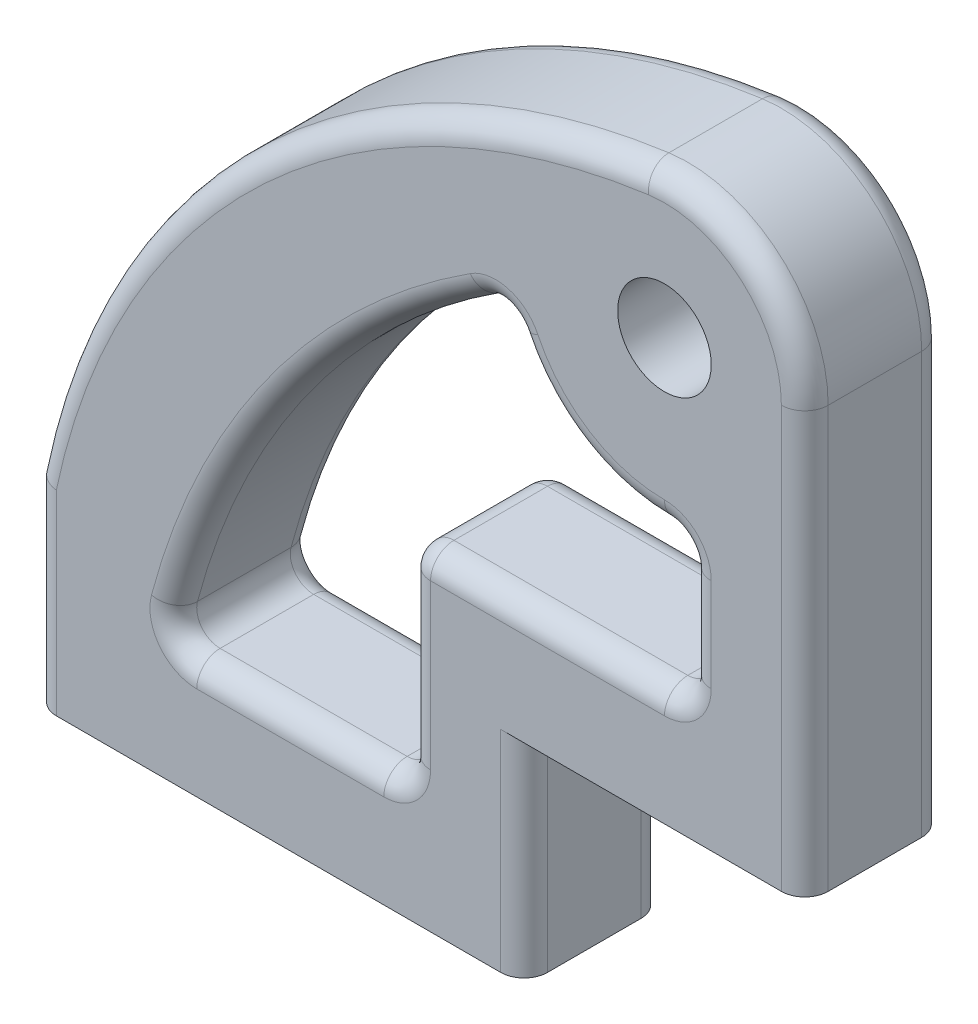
ISO-10303-21;
HEADER;
FILE_DESCRIPTION(('STEP AP214'),'2;1');
FILE_NAME('part.step','',(''),(''),'','','');
FILE_SCHEMA(('AUTOMOTIVE_DESIGN { 1 0 10303 214 1 1 1 1 }'));
ENDSEC;
DATA;
#1=APPLICATION_CONTEXT('core data for automotive mechanical design processes');
#2=APPLICATION_PROTOCOL_DEFINITION('international standard','automotive_design',2000,#1);
#3=PRODUCT_CONTEXT('',#1,'mechanical');
#4=PRODUCT('Part','Part','',(#3));
#5=PRODUCT_RELATED_PRODUCT_CATEGORY('part','',(#4));
#6=PRODUCT_DEFINITION_FORMATION('','',#4);
#7=PRODUCT_DEFINITION_CONTEXT('part definition',#1,'design');
#8=PRODUCT_DEFINITION('design','',#6,#7);
#9=PRODUCT_DEFINITION_SHAPE('','',#8);
#10=(LENGTH_UNIT() NAMED_UNIT(*) SI_UNIT(.MILLI.,.METRE.));
#11=(NAMED_UNIT(*) PLANE_ANGLE_UNIT() SI_UNIT($,.RADIAN.));
#12=(NAMED_UNIT(*) SI_UNIT($,.STERADIAN.) SOLID_ANGLE_UNIT());
#13=UNCERTAINTY_MEASURE_WITH_UNIT(LENGTH_MEASURE(1.E-05),#10,'distance_accuracy_value','');
#14=(GEOMETRIC_REPRESENTATION_CONTEXT(3) GLOBAL_UNCERTAINTY_ASSIGNED_CONTEXT((#13)) GLOBAL_UNIT_ASSIGNED_CONTEXT((#10,
#11,#12)) REPRESENTATION_CONTEXT('',''));
#15=CARTESIAN_POINT('',(0.,0.,0.));
#16=DIRECTION('',(0.,0.,1.));
#17=DIRECTION('',(1.,0.,0.));
#18=AXIS2_PLACEMENT_3D('',#15,#16,#17);
#19=CARTESIAN_POINT('',(60.7345188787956,4.45561327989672,12.));
#20=DIRECTION('',(0.,0.,1.));
#21=DIRECTION('',(1.,0.,0.));
#22=AXIS2_PLACEMENT_3D('',#19,#20,#21);
#23=PLANE('',#22);
#24=CARTESIAN_POINT('',(72.,-3.38561571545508,12.));
#25=DIRECTION('',(0.,0.,1.));
#26=DIRECTION('',(1.,0.,0.));
#27=AXIS2_PLACEMENT_3D('',#24,#25,#26);
#28=CIRCLE('',#27,64.);
#29=CARTESIAN_POINT('',(10.1399283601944,13.0257077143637,12.));
#30=VERTEX_POINT('',#29);
#31=CARTESIAN_POINT('',(37.4052744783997,50.4586501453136,12.));
#32=VERTEX_POINT('',#31);
#33=EDGE_CURVE('E317',#30,#32,#28,.F.);
#34=ORIENTED_EDGE('',*,*,#33,.T.);
#35=CARTESIAN_POINT('',(39.5674448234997,47.0933835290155,12.));
#36=DIRECTION('',(0.,0.,1.));
#37=DIRECTION('',(1.,0.,0.));
#38=AXIS2_PLACEMENT_3D('',#35,#36,#37);
#39=CIRCLE('',#38,4.);
#40=CARTESIAN_POINT('',(43.1755836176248,48.8200376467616,12.));
#41=VERTEX_POINT('',#40);
#42=EDGE_CURVE('E337',#32,#41,#39,.F.);
#43=ORIENTED_EDGE('',*,*,#42,.T.);
#44=CARTESIAN_POINT('',(54.,54.,12.));
#45=DIRECTION('',(0.,0.,1.));
#46=DIRECTION('',(1.,0.,0.));
#47=AXIS2_PLACEMENT_3D('',#44,#45,#46);
#48=CIRCLE('',#47,12.);
#49=CARTESIAN_POINT('',(54.,42.,12.));
#50=VERTEX_POINT('',#49);
#51=EDGE_CURVE('E335',#41,#50,#48,.T.);
#52=ORIENTED_EDGE('',*,*,#51,.T.);
#53=CARTESIAN_POINT('',(54.,38.,12.));
#54=DIRECTION('',(0.,0.,1.));
#55=DIRECTION('',(1.,0.,0.));
#56=AXIS2_PLACEMENT_3D('',#53,#54,#55);
#57=CIRCLE('',#56,4.);
#58=CARTESIAN_POINT('',(58.,38.,12.));
#59=VERTEX_POINT('',#58);
#60=EDGE_CURVE('E333',#50,#59,#57,.F.);
#61=ORIENTED_EDGE('',*,*,#60,.T.);
#62=DIRECTION('',(0.,1.,0.));
#63=VECTOR('',#62,1.);
#64=CARTESIAN_POINT('',(58.,4.45561327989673,12.));
#65=LINE('',#64,#63);
#66=CARTESIAN_POINT('',(58.,30.,12.));
#67=VERTEX_POINT('',#66);
#68=EDGE_CURVE('E331',#59,#67,#65,.F.);
#69=ORIENTED_EDGE('',*,*,#68,.T.);
#70=CARTESIAN_POINT('',(54.,30.,12.));
#71=DIRECTION('',(0.,0.,1.));
#72=DIRECTION('',(1.,0.,0.));
#73=AXIS2_PLACEMENT_3D('',#70,#71,#72);
#74=CIRCLE('',#73,4.);
#75=CARTESIAN_POINT('',(54.,26.,12.));
#76=VERTEX_POINT('',#75);
#77=EDGE_CURVE('E329',#67,#76,#74,.F.);
#78=ORIENTED_EDGE('',*,*,#77,.T.);
#79=DIRECTION('',(1.,0.,0.));
#80=VECTOR('',#79,1.);
#81=CARTESIAN_POINT('',(60.7345188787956,26.,12.));
#82=LINE('',#81,#80);
#83=CARTESIAN_POINT('',(34.,26.,12.));
#84=VERTEX_POINT('',#83);
#85=EDGE_CURVE('E327',#76,#84,#82,.F.);
#86=ORIENTED_EDGE('',*,*,#85,.T.);
#87=DIRECTION('',(0.,1.,0.));
#88=VECTOR('',#87,1.);
#89=CARTESIAN_POINT('',(34.,4.45561327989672,12.));
#90=LINE('',#89,#88);
#91=CARTESIAN_POINT('',(34.,12.,12.));
#92=VERTEX_POINT('',#91);
#93=EDGE_CURVE('E325',#84,#92,#90,.F.);
#94=ORIENTED_EDGE('',*,*,#93,.T.);
#95=CARTESIAN_POINT('',(30.,12.,12.));
#96=DIRECTION('',(0.,0.,1.));
#97=DIRECTION('',(1.,0.,0.));
#98=AXIS2_PLACEMENT_3D('',#95,#96,#97);
#99=CIRCLE('',#98,4.);
#100=CARTESIAN_POINT('',(30.,8.,12.));
#101=VERTEX_POINT('',#100);
#102=EDGE_CURVE('E323',#92,#101,#99,.F.);
#103=ORIENTED_EDGE('',*,*,#102,.T.);
#104=DIRECTION('',(1.,0.,0.));
#105=VECTOR('',#104,1.);
#106=CARTESIAN_POINT('',(60.7345188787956,7.99999999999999,12.));
#107=LINE('',#106,#105);
#108=CARTESIAN_POINT('',(14.0061828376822,8.00000000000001,12.));
#109=VERTEX_POINT('',#108);
#110=EDGE_CURVE('E321',#101,#109,#107,.F.);
#111=ORIENTED_EDGE('',*,*,#110,.T.);
#112=CARTESIAN_POINT('',(14.0061828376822,12.,12.));
#113=DIRECTION('',(0.,0.,1.));
#114=DIRECTION('',(1.,0.,0.));
#115=AXIS2_PLACEMENT_3D('',#112,#113,#114);
#116=CIRCLE('',#115,4.);
#117=EDGE_CURVE('E319',#109,#30,#116,.F.);
#118=ORIENTED_EDGE('',*,*,#117,.T.);
#119=EDGE_LOOP('',(#34,#43,#52,#61,#69,#78,#86,#94,#103,#111,#118));
#120=FACE_BOUND('',#119,.T.);
#121=DIRECTION('',(1.,0.,0.));
#122=VECTOR('',#121,1.);
#123=CARTESIAN_POINT('',(0.,0.,12.));
#124=LINE('',#123,#122);
#125=CARTESIAN_POINT('',(2.,0.,12.));
#126=VERTEX_POINT('',#125);
#127=CARTESIAN_POINT('',(40.,0.,12.));
#128=VERTEX_POINT('',#127);
#129=EDGE_CURVE('E301',#126,#128,#124,.T.);
#130=ORIENTED_EDGE('',*,*,#129,.T.);
#131=DIRECTION('',(0.,1.,0.));
#132=VECTOR('',#131,1.);
#133=CARTESIAN_POINT('',(40.,18.,12.));
#134=LINE('',#133,#132);
#135=CARTESIAN_POINT('',(40.,18.,12.));
#136=VERTEX_POINT('',#135);
#137=EDGE_CURVE('E349',#128,#136,#134,.T.);
#138=ORIENTED_EDGE('',*,*,#137,.T.);
#139=DIRECTION('',(1.,0.,0.));
#140=VECTOR('',#139,1.);
#141=CARTESIAN_POINT('',(42.,18.,12.));
#142=LINE('',#141,#140);
#143=CARTESIAN_POINT('',(64.,18.,12.));
#144=VERTEX_POINT('',#143);
#145=EDGE_CURVE('E610',#136,#144,#142,.T.);
#146=ORIENTED_EDGE('',*,*,#145,.T.);
#147=DIRECTION('',(0.,1.,0.));
#148=VECTOR('',#147,1.);
#149=CARTESIAN_POINT('',(64.,54.,12.));
#150=LINE('',#149,#148);
#151=CARTESIAN_POINT('',(64.,54.,12.));
#152=VERTEX_POINT('',#151);
#153=EDGE_CURVE('E346',#144,#152,#150,.T.);
#154=ORIENTED_EDGE('',*,*,#153,.T.);
#155=CARTESIAN_POINT('',(54.,54.,12.));
#156=DIRECTION('',(0.,0.,1.));
#157=DIRECTION('',(1.,0.,0.));
#158=AXIS2_PLACEMENT_3D('',#155,#156,#157);
#159=CIRCLE('',#158,10.);
#160=CARTESIAN_POINT('',(52.6530962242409,63.9088773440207,12.));
#161=VERTEX_POINT('',#160);
#162=EDGE_CURVE('E344',#152,#161,#159,.T.);
#163=ORIENTED_EDGE('',*,*,#162,.T.);
#164=CARTESIAN_POINT('',(60.7345188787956,4.45561327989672,12.));
#165=DIRECTION('',(0.,0.,1.));
#166=DIRECTION('',(1.,0.,0.));
#167=AXIS2_PLACEMENT_3D('',#164,#165,#166);
#168=CIRCLE('',#167,60.);
#169=CARTESIAN_POINT('',(2.,16.713520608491,12.));
#170=VERTEX_POINT('',#169);
#171=EDGE_CURVE('E342',#161,#170,#168,.T.);
#172=ORIENTED_EDGE('',*,*,#171,.T.);
#173=DIRECTION('',(0.,-1.,0.));
#174=VECTOR('',#173,1.);
#175=CARTESIAN_POINT('',(2.,0.,12.));
#176=LINE('',#175,#174);
#177=EDGE_CURVE('E340',#170,#126,#176,.T.);
#178=ORIENTED_EDGE('',*,*,#177,.T.);
#179=EDGE_LOOP('',(#130,#138,#146,#154,#163,#172,#178));
#180=FACE_BOUND('',#179,.T.);
#181=CARTESIAN_POINT('',(54.,54.,12.));
#182=DIRECTION('',(0.,0.,1.));
#183=DIRECTION('',(1.,0.,0.));
#184=AXIS2_PLACEMENT_3D('',#181,#182,#183);
#185=CIRCLE('',#184,4.00000000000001);
#186=CARTESIAN_POINT('',(58.,54.,12.));
#187=VERTEX_POINT('',#186);
#188=EDGE_CURVE('E567',#187,#187,#185,.T.);
#189=ORIENTED_EDGE('',*,*,#188,.F.);
#190=EDGE_LOOP('',(#189));
#191=FACE_BOUND('',#190,.T.);
#192=ADVANCED_FACE('F43',(#120,#180,#191),#23,.T.);
#193=CARTESIAN_POINT('',(60.7345188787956,4.45561327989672,0.));
#194=DIRECTION('',(0.,0.,1.));
#195=DIRECTION('',(1.,0.,0.));
#196=AXIS2_PLACEMENT_3D('',#193,#194,#195);
#197=PLANE('',#196);
#198=DIRECTION('',(0.,1.,0.));
#199=VECTOR('',#198,1.);
#200=CARTESIAN_POINT('',(58.,38.,0.));
#201=LINE('',#200,#199);
#202=CARTESIAN_POINT('',(58.,30.,0.));
#203=VERTEX_POINT('',#202);
#204=CARTESIAN_POINT('',(58.,38.,0.));
#205=VERTEX_POINT('',#204);
#206=EDGE_CURVE('E652',#203,#205,#201,.T.);
#207=ORIENTED_EDGE('',*,*,#206,.T.);
#208=CARTESIAN_POINT('',(54.,38.,0.));
#209=DIRECTION('',(0.,0.,1.));
#210=DIRECTION('',(1.,0.,0.));
#211=AXIS2_PLACEMENT_3D('',#208,#209,#210);
#212=CIRCLE('',#211,4.);
#213=CARTESIAN_POINT('',(54.,42.,0.));
#214=VERTEX_POINT('',#213);
#215=EDGE_CURVE('E654',#205,#214,#212,.T.);
#216=ORIENTED_EDGE('',*,*,#215,.T.);
#217=CARTESIAN_POINT('',(54.,54.,0.));
#218=DIRECTION('',(0.,0.,1.));
#219=DIRECTION('',(1.,0.,0.));
#220=AXIS2_PLACEMENT_3D('',#217,#218,#219);
#221=CIRCLE('',#220,12.);
#222=CARTESIAN_POINT('',(43.1755836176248,48.8200376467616,0.));
#223=VERTEX_POINT('',#222);
#224=EDGE_CURVE('E292',#214,#223,#221,.F.);
#225=ORIENTED_EDGE('',*,*,#224,.T.);
#226=CARTESIAN_POINT('',(39.5674448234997,47.0933835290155,0.));
#227=DIRECTION('',(0.,0.,1.));
#228=DIRECTION('',(1.,0.,0.));
#229=AXIS2_PLACEMENT_3D('',#226,#227,#228);
#230=CIRCLE('',#229,4.);
#231=CARTESIAN_POINT('',(37.4052744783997,50.4586501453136,0.));
#232=VERTEX_POINT('',#231);
#233=EDGE_CURVE('E636',#223,#232,#230,.T.);
#234=ORIENTED_EDGE('',*,*,#233,.T.);
#235=CARTESIAN_POINT('',(72.,-3.38561571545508,0.));
#236=DIRECTION('',(0.,0.,1.));
#237=DIRECTION('',(1.,0.,0.));
#238=AXIS2_PLACEMENT_3D('',#235,#236,#237);
#239=CIRCLE('',#238,64.);
#240=CARTESIAN_POINT('',(10.1399283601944,13.0257077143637,0.));
#241=VERTEX_POINT('',#240);
#242=EDGE_CURVE('E638',#232,#241,#239,.T.);
#243=ORIENTED_EDGE('',*,*,#242,.T.);
#244=CARTESIAN_POINT('',(14.0061828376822,12.,0.));
#245=DIRECTION('',(0.,0.,1.));
#246=DIRECTION('',(1.,0.,0.));
#247=AXIS2_PLACEMENT_3D('',#244,#245,#246);
#248=CIRCLE('',#247,4.);
#249=CARTESIAN_POINT('',(14.0061828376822,8.00000000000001,0.));
#250=VERTEX_POINT('',#249);
#251=EDGE_CURVE('E640',#241,#250,#248,.T.);
#252=ORIENTED_EDGE('',*,*,#251,.T.);
#253=DIRECTION('',(1.,0.,0.));
#254=VECTOR('',#253,1.);
#255=CARTESIAN_POINT('',(30.,8.,0.));
#256=LINE('',#255,#254);
#257=CARTESIAN_POINT('',(30.,8.,0.));
#258=VERTEX_POINT('',#257);
#259=EDGE_CURVE('E642',#250,#258,#256,.T.);
#260=ORIENTED_EDGE('',*,*,#259,.T.);
#261=CARTESIAN_POINT('',(30.,12.,0.));
#262=DIRECTION('',(0.,0.,1.));
#263=DIRECTION('',(1.,0.,0.));
#264=AXIS2_PLACEMENT_3D('',#261,#262,#263);
#265=CIRCLE('',#264,4.);
#266=CARTESIAN_POINT('',(34.,12.,0.));
#267=VERTEX_POINT('',#266);
#268=EDGE_CURVE('E644',#258,#267,#265,.T.);
#269=ORIENTED_EDGE('',*,*,#268,.T.);
#270=DIRECTION('',(0.,1.,0.));
#271=VECTOR('',#270,1.);
#272=CARTESIAN_POINT('',(34.,26.,0.));
#273=LINE('',#272,#271);
#274=CARTESIAN_POINT('',(34.,26.,0.));
#275=VERTEX_POINT('',#274);
#276=EDGE_CURVE('E646',#267,#275,#273,.T.);
#277=ORIENTED_EDGE('',*,*,#276,.T.);
#278=DIRECTION('',(1.,0.,0.));
#279=VECTOR('',#278,1.);
#280=CARTESIAN_POINT('',(54.,26.,0.));
#281=LINE('',#280,#279);
#282=CARTESIAN_POINT('',(54.,26.,0.));
#283=VERTEX_POINT('',#282);
#284=EDGE_CURVE('E648',#275,#283,#281,.T.);
#285=ORIENTED_EDGE('',*,*,#284,.T.);
#286=CARTESIAN_POINT('',(54.,30.,0.));
#287=DIRECTION('',(0.,0.,1.));
#288=DIRECTION('',(1.,0.,0.));
#289=AXIS2_PLACEMENT_3D('',#286,#287,#288);
#290=CIRCLE('',#289,4.);
#291=EDGE_CURVE('E650',#283,#203,#290,.T.);
#292=ORIENTED_EDGE('',*,*,#291,.T.);
#293=EDGE_LOOP('',(#207,#216,#225,#234,#243,#252,#260,#269,#277,#285,#292));
#294=FACE_BOUND('',#293,.T.);
#295=DIRECTION('',(1.,0.,0.));
#296=VECTOR('',#295,1.);
#297=CARTESIAN_POINT('',(42.,18.,0.));
#298=LINE('',#297,#296);
#299=CARTESIAN_POINT('',(40.,18.,0.));
#300=VERTEX_POINT('',#299);
#301=CARTESIAN_POINT('',(64.,18.,0.));
#302=VERTEX_POINT('',#301);
#303=EDGE_CURVE('E285',#300,#302,#298,.T.);
#304=ORIENTED_EDGE('',*,*,#303,.F.);
#305=DIRECTION('',(0.,1.,0.));
#306=VECTOR('',#305,1.);
#307=CARTESIAN_POINT('',(40.,4.45561327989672,0.));
#308=LINE('',#307,#306);
#309=CARTESIAN_POINT('',(40.,0.,0.));
#310=VERTEX_POINT('',#309);
#311=EDGE_CURVE('E657',#300,#310,#308,.F.);
#312=ORIENTED_EDGE('',*,*,#311,.T.);
#313=DIRECTION('',(1.,0.,0.));
#314=VECTOR('',#313,1.);
#315=CARTESIAN_POINT('',(0.,0.,0.));
#316=LINE('',#315,#314);
#317=CARTESIAN_POINT('',(0.900185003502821,0.,0.));
#318=VERTEX_POINT('',#317);
#319=EDGE_CURVE('E302',#318,#310,#316,.T.);
#320=ORIENTED_EDGE('',*,*,#319,.F.);
#321=CARTESIAN_POINT('',(60.7345188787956,4.45561327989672,0.));
#322=DIRECTION('',(0.,0.,1.));
#323=DIRECTION('',(1.,0.,0.));
#324=AXIS2_PLACEMENT_3D('',#321,#322,#323);
#325=CIRCLE('',#324,60.);
#326=CARTESIAN_POINT('',(52.6530962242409,63.9088773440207,0.));
#327=VERTEX_POINT('',#326);
#328=EDGE_CURVE('E632',#318,#327,#325,.F.);
#329=ORIENTED_EDGE('',*,*,#328,.T.);
#330=CARTESIAN_POINT('',(54.,54.,0.));
#331=DIRECTION('',(0.,0.,1.));
#332=DIRECTION('',(1.,0.,0.));
#333=AXIS2_PLACEMENT_3D('',#330,#331,#332);
#334=CIRCLE('',#333,10.);
#335=CARTESIAN_POINT('',(64.,54.,0.));
#336=VERTEX_POINT('',#335);
#337=EDGE_CURVE('E288',#327,#336,#334,.F.);
#338=ORIENTED_EDGE('',*,*,#337,.T.);
#339=DIRECTION('',(0.,1.,0.));
#340=VECTOR('',#339,1.);
#341=CARTESIAN_POINT('',(64.,4.45561327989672,0.));
#342=LINE('',#341,#340);
#343=EDGE_CURVE('E281',#336,#302,#342,.F.);
#344=ORIENTED_EDGE('',*,*,#343,.T.);
#345=EDGE_LOOP('',(#304,#312,#320,#329,#338,#344));
#346=FACE_BOUND('',#345,.T.);
#347=CARTESIAN_POINT('',(54.,54.,0.));
#348=DIRECTION('',(0.,0.,1.));
#349=DIRECTION('',(1.,0.,0.));
#350=AXIS2_PLACEMENT_3D('',#347,#348,#349);
#351=CIRCLE('',#350,4.00000000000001);
#352=CARTESIAN_POINT('',(58.,54.,0.));
#353=VERTEX_POINT('',#352);
#354=EDGE_CURVE('E438',#353,#353,#351,.T.);
#355=ORIENTED_EDGE('',*,*,#354,.T.);
#356=EDGE_LOOP('',(#355));
#357=FACE_BOUND('',#356,.T.);
#358=ADVANCED_FACE('F283',(#294,#346,#357),#197,.F.);
#359=CARTESIAN_POINT('',(0.,0.,12.));
#360=DIRECTION('',(1.,0.,0.));
#361=DIRECTION('',(0.,0.,-1.));
#362=AXIS2_PLACEMENT_3D('',#359,#360,#361);
#363=PLANE('',#362);
#364=DIRECTION('',(0.,0.,-1.));
#365=VECTOR('',#364,1.);
#366=CARTESIAN_POINT('',(0.,16.9182862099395,12.));
#367=LINE('',#366,#365);
#368=CARTESIAN_POINT('',(0.,16.9182862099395,10.));
#369=VERTEX_POINT('',#368);
#370=CARTESIAN_POINT('',(0.,16.9182862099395,2.));
#371=VERTEX_POINT('',#370);
#372=EDGE_CURVE('E613',#369,#371,#367,.T.);
#373=ORIENTED_EDGE('',*,*,#372,.T.);
#374=CARTESIAN_POINT('',(0.,16.9182862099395,2.));
#375=CARTESIAN_POINT('',(0.,16.9183565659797,1.9752671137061));
#376=CARTESIAN_POINT('',(0.,16.9160069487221,1.95062974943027));
#377=CARTESIAN_POINT('',(0.,16.907131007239,1.90243010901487));
#378=CARTESIAN_POINT('',(0.,16.9006583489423,1.87885812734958));
#379=CARTESIAN_POINT('',(0.,16.8817177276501,1.82619484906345));
#380=CARTESIAN_POINT('',(0.,16.8680391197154,1.79754747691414));
#381=CARTESIAN_POINT('',(0.,16.8363008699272,1.7426732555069));
#382=CARTESIAN_POINT('',(0.,16.818216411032,1.71646132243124));
#383=CARTESIAN_POINT('',(0.,16.7643421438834,1.64771380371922));
#384=CARTESIAN_POINT('',(0.,16.7254358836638,1.60765539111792));
#385=CARTESIAN_POINT('',(0.,16.6425864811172,1.5333003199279));
#386=CARTESIAN_POINT('',(0.,16.5986327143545,1.49901620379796));
#387=CARTESIAN_POINT('',(0.,16.4839412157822,1.41797968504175));
#388=CARTESIAN_POINT('',(0.,16.4112131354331,1.37407801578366));
#389=CARTESIAN_POINT('',(0.,16.2620172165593,1.29305788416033));
#390=CARTESIAN_POINT('',(0.,16.1855409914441,1.2559556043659));
#391=CARTESIAN_POINT('',(0.,16.0299090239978,1.18657906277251));
#392=CARTESIAN_POINT('',(0.,15.9507401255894,1.1543346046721));
#393=CARTESIAN_POINT('',(0.,15.7910393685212,1.09378838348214));
#394=CARTESIAN_POINT('',(0.,15.710509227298,1.06548201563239));
#395=CARTESIAN_POINT('',(0.,15.5451032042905,1.01087704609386));
#396=CARTESIAN_POINT('',(0.,15.4601846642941,0.984708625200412));
#397=CARTESIAN_POINT('',(0.,15.2895449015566,0.935119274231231));
#398=CARTESIAN_POINT('',(0.,15.2038235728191,0.911698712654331));
#399=CARTESIAN_POINT('',(0.,14.9456858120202,0.844836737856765));
#400=CARTESIAN_POINT('',(0.,14.7723818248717,0.804822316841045));
#401=CARTESIAN_POINT('',(0.,14.4239646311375,0.731428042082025));
#402=CARTESIAN_POINT('',(0.,14.2488479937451,0.698064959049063));
#403=CARTESIAN_POINT('',(0.,13.8977524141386,0.636614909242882));
#404=CARTESIAN_POINT('',(0.,13.7217737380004,0.608526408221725));
#405=CARTESIAN_POINT('',(0.,13.3686226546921,0.556494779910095));
#406=CARTESIAN_POINT('',(0.,13.1914482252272,0.532565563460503));
#407=CARTESIAN_POINT('',(0.,12.836652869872,0.48821218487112));
#408=CARTESIAN_POINT('',(0.,12.6590319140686,0.467788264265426));
#409=CARTESIAN_POINT('',(0.,12.3037409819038,0.429906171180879));
#410=CARTESIAN_POINT('',(0.,12.1260714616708,0.412443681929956));
#411=CARTESIAN_POINT('',(0.,11.7705119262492,0.380007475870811));
#412=CARTESIAN_POINT('',(0.,11.5926219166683,0.365033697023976));
#413=CARTESIAN_POINT('',(0.,11.1732885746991,0.332262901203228));
#414=CARTESIAN_POINT('',(0.,10.9317755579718,0.315359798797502));
#415=CARTESIAN_POINT('',(0.,10.4485436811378,0.284777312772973));
#416=CARTESIAN_POINT('',(0.,10.2068248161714,0.27109800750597));
#417=CARTESIAN_POINT('',(0.,9.48142487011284,0.234054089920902));
#418=CARTESIAN_POINT('',(0.,8.9975398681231,0.214686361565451));
#419=CARTESIAN_POINT('',(0.,8.02902338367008,0.183508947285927));
#420=CARTESIAN_POINT('',(0.,7.54439165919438,0.171707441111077));
#421=CARTESIAN_POINT('',(0.,6.57504602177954,0.153844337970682));
#422=CARTESIAN_POINT('',(0.,6.09033211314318,0.147782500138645));
#423=CARTESIAN_POINT('',(0.,5.13798693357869,0.140544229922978));
#424=CARTESIAN_POINT('',(0.,4.67035681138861,0.139202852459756));
#425=CARTESIAN_POINT('',(0.,3.73510221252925,0.140738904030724));
#426=CARTESIAN_POINT('',(0.,3.26747773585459,0.143616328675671));
#427=CARTESIAN_POINT('',(0.,2.56650633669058,0.151434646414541));
#428=CARTESIAN_POINT('',(0.,2.33313913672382,0.154619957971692));
#429=CARTESIAN_POINT('',(0.,1.8664264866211,0.162283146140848));
#430=CARTESIAN_POINT('',(0.,1.63308103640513,0.166761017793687));
#431=CARTESIAN_POINT('',(0.,1.16641778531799,0.177167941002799));
#432=CARTESIAN_POINT('',(0.,0.933099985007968,0.183097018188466));
#433=CARTESIAN_POINT('',(0.,0.466510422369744,0.196634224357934));
#434=CARTESIAN_POINT('',(0.,0.233238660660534,0.204242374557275));
#435=CARTESIAN_POINT('',(0.,0.,0.212803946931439));
#436=B_SPLINE_CURVE_WITH_KNOTS('',3,(#374,#375,#376,#377,#378,#379,#380,#381,#382,#383,#384,
#385,#386,#387,#388,#389,#390,#391,#392,#393,#394,#395,#396,#397,#398,#399,#400,#401,#402,#403,
#404,#405,#406,#407,#408,#409,#410,#411,#412,#413,#414,#415,#416,#417,#418,#419,#420,#421,#422,
#423,#424,#425,#426,#427,#428,#429,#430,#431,#432,#433,#434,#435),.UNSPECIFIED.,.F.,.F.,(4,2,2,
2,2,2,2,2,2,2,2,2,2,2,2,2,2,2,2,2,2,2,2,2,2,2,2,2,2,2,4),(0.,0.0739331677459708,
0.146923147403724,0.241624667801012,0.336872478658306,0.503455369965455,0.670395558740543,
0.924602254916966,1.1794063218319,1.43571503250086,1.69172147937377,1.95824070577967,
2.22479563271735,2.75817639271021,3.29288546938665,3.82743877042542,4.3637468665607,
4.90009190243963,5.4356482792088,5.97119130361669,6.69747442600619,7.4237751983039,
8.87649532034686,10.3307833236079,11.7850102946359,13.1878887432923,14.5907657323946,
15.29092972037,15.9910910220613,16.6912646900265,17.3914472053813),.UNSPECIFIED.);
#437=CARTESIAN_POINT('',(0.,0.,0.212803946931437));
#438=VERTEX_POINT('',#437);
#439=EDGE_CURVE('E394',#371,#438,#436,.T.);
#440=ORIENTED_EDGE('',*,*,#439,.T.);
#441=DIRECTION('',(0.,0.,-1.));
#442=VECTOR('',#441,1.);
#443=CARTESIAN_POINT('',(0.,0.,12.));
#444=LINE('',#443,#442);
#445=CARTESIAN_POINT('',(0.,0.,10.));
#446=VERTEX_POINT('',#445);
#447=EDGE_CURVE('E629',#446,#438,#444,.T.);
#448=ORIENTED_EDGE('',*,*,#447,.F.);
#449=DIRECTION('',(0.,-1.,0.));
#450=VECTOR('',#449,1.);
#451=CARTESIAN_POINT('',(0.,16.9182862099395,10.));
#452=LINE('',#451,#450);
#453=EDGE_CURVE('E67',#446,#369,#452,.F.);
#454=ORIENTED_EDGE('',*,*,#453,.T.);
#455=EDGE_LOOP('',(#373,#440,#448,#454));
#456=FACE_BOUND('',#455,.T.);
#457=ADVANCED_FACE('F385',(#456),#363,.F.);
#458=CARTESIAN_POINT('',(0.,0.,12.));
#459=DIRECTION('',(0.,1.,0.));
#460=DIRECTION('',(0.,0.,1.));
#461=AXIS2_PLACEMENT_3D('',#458,#459,#460);
#462=PLANE('',#461);
#463=CARTESIAN_POINT('',(10.,0.,6.));
#464=DIRECTION('',(0.,-1.,0.));
#465=DIRECTION('',(0.,0.,-1.));
#466=AXIS2_PLACEMENT_3D('',#463,#464,#465);
#467=CIRCLE('',#466,2.49999999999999);
#468=CARTESIAN_POINT('',(10.,0.,3.50000000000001));
#469=VERTEX_POINT('',#468);
#470=EDGE_CURVE('E981',#469,#469,#467,.T.);
#471=ORIENTED_EDGE('',*,*,#470,.F.);
#472=EDGE_LOOP('',(#471));
#473=FACE_BOUND('',#472,.T.);
#474=CARTESIAN_POINT('',(32.,0.,6.));
#475=DIRECTION('',(0.,-1.,0.));
#476=DIRECTION('',(0.,0.,-1.));
#477=AXIS2_PLACEMENT_3D('',#474,#475,#476);
#478=CIRCLE('',#477,2.49999999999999);
#479=CARTESIAN_POINT('',(32.,0.,3.50000000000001));
#480=VERTEX_POINT('',#479);
#481=EDGE_CURVE('E563',#480,#480,#478,.T.);
#482=ORIENTED_EDGE('',*,*,#481,.F.);
#483=EDGE_LOOP('',(#482));
#484=FACE_BOUND('',#483,.T.);
#485=ORIENTED_EDGE('',*,*,#319,.T.);
#486=CARTESIAN_POINT('',(40.,0.,2.));
#487=DIRECTION('',(0.,1.,0.));
#488=DIRECTION('',(0.,0.,1.));
#489=AXIS2_PLACEMENT_3D('',#486,#487,#488);
#490=CIRCLE('',#489,2.);
#491=CARTESIAN_POINT('',(42.,0.,2.));
#492=VERTEX_POINT('',#491);
#493=EDGE_CURVE('E373',#310,#492,#490,.F.);
#494=ORIENTED_EDGE('',*,*,#493,.T.);
#495=DIRECTION('',(0.,0.,-1.));
#496=VECTOR('',#495,1.);
#497=CARTESIAN_POINT('',(42.,0.,12.));
#498=LINE('',#497,#496);
#499=CARTESIAN_POINT('',(42.,0.,10.));
#500=VERTEX_POINT('',#499);
#501=EDGE_CURVE('E626',#500,#492,#498,.T.);
#502=ORIENTED_EDGE('',*,*,#501,.F.);
#503=CARTESIAN_POINT('',(40.,0.,10.));
#504=DIRECTION('',(0.,1.,0.));
#505=DIRECTION('',(0.,0.,1.));
#506=AXIS2_PLACEMENT_3D('',#503,#504,#505);
#507=CIRCLE('',#506,2.);
#508=EDGE_CURVE('E363',#500,#128,#507,.F.);
#509=ORIENTED_EDGE('',*,*,#508,.T.);
#510=ORIENTED_EDGE('',*,*,#129,.F.);
#511=CARTESIAN_POINT('',(2.,0.,10.));
#512=DIRECTION('',(0.,1.,0.));
#513=DIRECTION('',(0.,0.,1.));
#514=AXIS2_PLACEMENT_3D('',#511,#512,#513);
#515=CIRCLE('',#514,2.);
#516=EDGE_CURVE('E361',#126,#446,#515,.F.);
#517=ORIENTED_EDGE('',*,*,#516,.T.);
#518=ORIENTED_EDGE('',*,*,#447,.T.);
#519=CARTESIAN_POINT('',(0.,0.,0.212803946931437));
#520=CARTESIAN_POINT('',(0.0509926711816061,0.,0.187250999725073));
#521=CARTESIAN_POINT('',(0.103079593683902,0.,0.163882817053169));
#522=CARTESIAN_POINT('',(0.209073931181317,0.,0.121648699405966));
#523=CARTESIAN_POINT('',(0.262982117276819,0.,0.102784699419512));
#524=CARTESIAN_POINT('',(0.371162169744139,0.,0.0700300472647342));
#525=CARTESIAN_POINT('',(0.425407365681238,0.,0.0560511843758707));
#526=CARTESIAN_POINT('',(0.534848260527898,0.,0.0326737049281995));
#527=CARTESIAN_POINT('',(0.590043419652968,0.,0.0232725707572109));
#528=CARTESIAN_POINT('',(0.687589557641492,0.,0.0108191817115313));
#529=CARTESIAN_POINT('',(0.729817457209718,0.,0.00678120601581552));
#530=CARTESIAN_POINT('',(0.814756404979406,0.,0.0013610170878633));
#531=CARTESIAN_POINT('',(0.857468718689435,0.,-1.37260226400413E-06));
#532=CARTESIAN_POINT('',(0.90018500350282,0.,0.));
#533=B_SPLINE_CURVE_WITH_KNOTS('',3,(#519,#520,#521,#522,#523,#524,#525,#526,#527,#528,#529,
#530,#531,#532),.UNSPECIFIED.,.F.,.F.,(4,2,2,2,2,2,4),(0.,0.17105883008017,0.342191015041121,
0.510050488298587,0.677817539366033,0.804998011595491,0.93311726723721),.UNSPECIFIED.);
#534=EDGE_CURVE('E365',#438,#318,#533,.T.);
#535=ORIENTED_EDGE('',*,*,#534,.T.);
#536=EDGE_LOOP('',(#485,#494,#502,#509,#510,#517,#518,#535));
#537=FACE_BOUND('',#536,.T.);
#538=ADVANCED_FACE('F379',(#473,#484,#537),#462,.F.);
#539=CARTESIAN_POINT('',(42.,0.,12.));
#540=DIRECTION('',(-1.,0.,0.));
#541=DIRECTION('',(0.,0.,1.));
#542=AXIS2_PLACEMENT_3D('',#539,#540,#541);
#543=PLANE('',#542);
#544=ORIENTED_EDGE('',*,*,#501,.T.);
#545=DIRECTION('',(0.,1.,0.));
#546=VECTOR('',#545,1.);
#547=CARTESIAN_POINT('',(42.,0.,2.));
#548=LINE('',#547,#546);
#549=CARTESIAN_POINT('',(42.,18.,2.));
#550=VERTEX_POINT('',#549);
#551=EDGE_CURVE('E358',#492,#550,#548,.T.);
#552=ORIENTED_EDGE('',*,*,#551,.T.);
#553=DIRECTION('',(0.,0.,-1.));
#554=VECTOR('',#553,1.);
#555=CARTESIAN_POINT('',(42.,18.,12.));
#556=LINE('',#555,#554);
#557=CARTESIAN_POINT('',(42.,18.,10.));
#558=VERTEX_POINT('',#557);
#559=EDGE_CURVE('E624',#558,#550,#556,.T.);
#560=ORIENTED_EDGE('',*,*,#559,.F.);
#561=DIRECTION('',(0.,1.,0.));
#562=VECTOR('',#561,1.);
#563=CARTESIAN_POINT('',(42.,0.,10.));
#564=LINE('',#563,#562);
#565=EDGE_CURVE('E356',#558,#500,#564,.F.);
#566=ORIENTED_EDGE('',*,*,#565,.T.);
#567=EDGE_LOOP('',(#544,#552,#560,#566));
#568=FACE_BOUND('',#567,.T.);
#569=ADVANCED_FACE('F384',(#568),#543,.F.);
#570=CARTESIAN_POINT('',(42.,18.,12.));
#571=DIRECTION('',(0.,1.,0.));
#572=DIRECTION('',(0.,0.,1.));
#573=AXIS2_PLACEMENT_3D('',#570,#571,#572);
#574=PLANE('',#573);
#575=CARTESIAN_POINT('',(54.,18.,6.));
#576=DIRECTION('',(0.,-1.,0.));
#577=DIRECTION('',(0.,0.,-1.));
#578=AXIS2_PLACEMENT_3D('',#575,#576,#577);
#579=CIRCLE('',#578,2.49999999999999);
#580=CARTESIAN_POINT('',(54.,18.,3.50000000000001));
#581=VERTEX_POINT('',#580);
#582=EDGE_CURVE('E555',#581,#581,#579,.T.);
#583=ORIENTED_EDGE('',*,*,#582,.F.);
#584=EDGE_LOOP('',(#583));
#585=FACE_BOUND('',#584,.T.);
#586=ORIENTED_EDGE('',*,*,#303,.T.);
#587=CARTESIAN_POINT('',(64.,18.,2.));
#588=DIRECTION('',(0.,1.,0.));
#589=DIRECTION('',(0.,0.,1.));
#590=AXIS2_PLACEMENT_3D('',#587,#588,#589);
#591=CIRCLE('',#590,2.);
#592=CARTESIAN_POINT('',(66.,18.,2.));
#593=VERTEX_POINT('',#592);
#594=EDGE_CURVE('E297',#302,#593,#591,.F.);
#595=ORIENTED_EDGE('',*,*,#594,.T.);
#596=DIRECTION('',(0.,0.,-1.));
#597=VECTOR('',#596,1.);
#598=CARTESIAN_POINT('',(66.,18.,12.));
#599=LINE('',#598,#597);
#600=CARTESIAN_POINT('',(66.,18.,10.));
#601=VERTEX_POINT('',#600);
#602=EDGE_CURVE('E622',#601,#593,#599,.T.);
#603=ORIENTED_EDGE('',*,*,#602,.F.);
#604=CARTESIAN_POINT('',(64.,18.,10.));
#605=DIRECTION('',(0.,1.,0.));
#606=DIRECTION('',(0.,0.,1.));
#607=AXIS2_PLACEMENT_3D('',#604,#605,#606);
#608=CIRCLE('',#607,2.);
#609=EDGE_CURVE('E309',#601,#144,#608,.F.);
#610=ORIENTED_EDGE('',*,*,#609,.T.);
#611=ORIENTED_EDGE('',*,*,#145,.F.);
#612=CARTESIAN_POINT('',(40.,18.,10.));
#613=DIRECTION('',(0.,1.,0.));
#614=DIRECTION('',(0.,0.,1.));
#615=AXIS2_PLACEMENT_3D('',#612,#613,#614);
#616=CIRCLE('',#615,2.);
#617=EDGE_CURVE('E11',#136,#558,#616,.T.);
#618=ORIENTED_EDGE('',*,*,#617,.T.);
#619=ORIENTED_EDGE('',*,*,#559,.T.);
#620=CARTESIAN_POINT('',(40.,18.,2.));
#621=DIRECTION('',(0.,1.,0.));
#622=DIRECTION('',(0.,0.,1.));
#623=AXIS2_PLACEMENT_3D('',#620,#621,#622);
#624=CIRCLE('',#623,2.);
#625=EDGE_CURVE('E52',#550,#300,#624,.T.);
#626=ORIENTED_EDGE('',*,*,#625,.T.);
#627=EDGE_LOOP('',(#586,#595,#603,#610,#611,#618,#619,#626));
#628=FACE_BOUND('',#627,.T.);
#629=ADVANCED_FACE('F295',(#585,#628),#574,.F.);
#630=CARTESIAN_POINT('',(66.,18.,12.));
#631=DIRECTION('',(-1.,0.,0.));
#632=DIRECTION('',(0.,0.,1.));
#633=AXIS2_PLACEMENT_3D('',#630,#631,#632);
#634=PLANE('',#633);
#635=ORIENTED_EDGE('',*,*,#602,.T.);
#636=DIRECTION('',(0.,1.,0.));
#637=VECTOR('',#636,1.);
#638=CARTESIAN_POINT('',(66.,18.,2.));
#639=LINE('',#638,#637);
#640=CARTESIAN_POINT('',(66.,54.,2.));
#641=VERTEX_POINT('',#640);
#642=EDGE_CURVE('E307',#593,#641,#639,.T.);
#643=ORIENTED_EDGE('',*,*,#642,.T.);
#644=DIRECTION('',(0.,0.,-1.));
#645=VECTOR('',#644,1.);
#646=CARTESIAN_POINT('',(66.,54.,12.));
#647=LINE('',#646,#645);
#648=CARTESIAN_POINT('',(66.,54.,10.));
#649=VERTEX_POINT('',#648);
#650=EDGE_CURVE('E619',#649,#641,#647,.T.);
#651=ORIENTED_EDGE('',*,*,#650,.F.);
#652=DIRECTION('',(0.,1.,0.));
#653=VECTOR('',#652,1.);
#654=CARTESIAN_POINT('',(66.,18.,10.));
#655=LINE('',#654,#653);
#656=EDGE_CURVE('E705',#649,#601,#655,.F.);
#657=ORIENTED_EDGE('',*,*,#656,.T.);
#658=EDGE_LOOP('',(#635,#643,#651,#657));
#659=FACE_BOUND('',#658,.T.);
#660=ADVANCED_FACE('F543',(#659),#634,.F.);
#661=CARTESIAN_POINT('',(54.,54.,12.));
#662=DIRECTION('',(0.,0.,-1.));
#663=DIRECTION('',(-1.,0.,0.));
#664=AXIS2_PLACEMENT_3D('',#661,#662,#663);
#665=CYLINDRICAL_SURFACE('',#664,12.);
#666=ORIENTED_EDGE('',*,*,#650,.T.);
#667=CARTESIAN_POINT('',(54.,54.,2.));
#668=DIRECTION('',(0.,0.,1.));
#669=DIRECTION('',(1.,0.,0.));
#670=AXIS2_PLACEMENT_3D('',#667,#668,#669);
#671=CIRCLE('',#670,12.);
#672=CARTESIAN_POINT('',(52.3837154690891,65.8906528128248,2.));
#673=VERTEX_POINT('',#672);
#674=EDGE_CURVE('E311',#641,#673,#671,.T.);
#675=ORIENTED_EDGE('',*,*,#674,.T.);
#676=DIRECTION('',(0.,0.,-1.));
#677=VECTOR('',#676,1.);
#678=CARTESIAN_POINT('',(52.3837154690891,65.8906528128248,12.));
#679=LINE('',#678,#677);
#680=CARTESIAN_POINT('',(52.3837154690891,65.8906528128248,10.));
#681=VERTEX_POINT('',#680);
#682=EDGE_CURVE('E617',#681,#673,#679,.T.);
#683=ORIENTED_EDGE('',*,*,#682,.F.);
#684=CARTESIAN_POINT('',(54.,54.,10.));
#685=DIRECTION('',(0.,0.,1.));
#686=DIRECTION('',(1.,0.,0.));
#687=AXIS2_PLACEMENT_3D('',#684,#685,#686);
#688=CIRCLE('',#687,12.);
#689=EDGE_CURVE('E308',#681,#649,#688,.F.);
#690=ORIENTED_EDGE('',*,*,#689,.T.);
#691=EDGE_LOOP('',(#666,#675,#683,#690));
#692=FACE_BOUND('',#691,.T.);
#693=ADVANCED_FACE('F540',(#692),#665,.T.);
#694=CARTESIAN_POINT('',(60.7345188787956,4.45561327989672,12.));
#695=DIRECTION('',(0.,0.,-1.));
#696=DIRECTION('',(-1.,0.,0.));
#697=AXIS2_PLACEMENT_3D('',#694,#695,#696);
#698=CYLINDRICAL_SURFACE('',#697,62.);
#699=ORIENTED_EDGE('',*,*,#682,.T.);
#700=CARTESIAN_POINT('',(60.7345188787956,4.45561327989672,2.));
#701=DIRECTION('',(0.,0.,1.));
#702=DIRECTION('',(1.,0.,0.));
#703=AXIS2_PLACEMENT_3D('',#700,#701,#702);
#704=CIRCLE('',#703,62.);
#705=EDGE_CURVE('E60',#673,#371,#704,.T.);
#706=ORIENTED_EDGE('',*,*,#705,.T.);
#707=ORIENTED_EDGE('',*,*,#372,.F.);
#708=CARTESIAN_POINT('',(60.7345188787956,4.45561327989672,10.));
#709=DIRECTION('',(0.,0.,1.));
#710=DIRECTION('',(1.,0.,0.));
#711=AXIS2_PLACEMENT_3D('',#708,#709,#710);
#712=CIRCLE('',#711,62.);
#713=EDGE_CURVE('E1299',#369,#681,#712,.F.);
#714=ORIENTED_EDGE('',*,*,#713,.T.);
#715=EDGE_LOOP('',(#699,#706,#707,#714));
#716=FACE_BOUND('',#715,.T.);
#717=ADVANCED_FACE('F537',(#716),#698,.T.);
#718=CARTESIAN_POINT('',(14.0061828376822,12.,12.));
#719=DIRECTION('',(0.,0.,-1.));
#720=DIRECTION('',(-1.,0.,0.));
#721=AXIS2_PLACEMENT_3D('',#718,#719,#720);
#722=CYLINDRICAL_SURFACE('',#721,2.);
#723=DIRECTION('',(0.,0.,-1.));
#724=VECTOR('',#723,1.);
#725=CARTESIAN_POINT('',(14.0061828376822,10.,12.));
#726=LINE('',#725,#724);
#727=CARTESIAN_POINT('',(14.0061828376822,10.,10.));
#728=VERTEX_POINT('',#727);
#729=CARTESIAN_POINT('',(14.0061828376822,10.,2.));
#730=VERTEX_POINT('',#729);
#731=EDGE_CURVE('E605',#728,#730,#726,.T.);
#732=ORIENTED_EDGE('',*,*,#731,.T.);
#733=CARTESIAN_POINT('',(14.0061828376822,12.,2.));
#734=DIRECTION('',(0.,0.,1.));
#735=DIRECTION('',(1.,0.,0.));
#736=AXIS2_PLACEMENT_3D('',#733,#734,#735);
#737=CIRCLE('',#736,2.);
#738=CARTESIAN_POINT('',(12.0730555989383,12.5128538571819,2.));
#739=VERTEX_POINT('',#738);
#740=EDGE_CURVE('E694',#730,#739,#737,.F.);
#741=ORIENTED_EDGE('',*,*,#740,.T.);
#742=DIRECTION('',(0.,0.,-1.));
#743=VECTOR('',#742,1.);
#744=CARTESIAN_POINT('',(12.0730555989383,12.5128538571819,12.));
#745=LINE('',#744,#743);
#746=CARTESIAN_POINT('',(12.0730555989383,12.5128538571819,10.));
#747=VERTEX_POINT('',#746);
#748=EDGE_CURVE('E570',#747,#739,#745,.T.);
#749=ORIENTED_EDGE('',*,*,#748,.F.);
#750=CARTESIAN_POINT('',(14.0061828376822,12.,10.));
#751=DIRECTION('',(0.,0.,1.));
#752=DIRECTION('',(1.,0.,0.));
#753=AXIS2_PLACEMENT_3D('',#750,#751,#752);
#754=CIRCLE('',#753,2.);
#755=EDGE_CURVE('E692',#747,#728,#754,.T.);
#756=ORIENTED_EDGE('',*,*,#755,.T.);
#757=EDGE_LOOP('',(#732,#741,#749,#756));
#758=FACE_BOUND('',#757,.T.);
#759=ADVANCED_FACE('F534',(#758),#722,.F.);
#760=CARTESIAN_POINT('',(30.,10.,12.));
#761=DIRECTION('',(0.,1.,0.));
#762=DIRECTION('',(-1.,0.,0.));
#763=AXIS2_PLACEMENT_3D('',#760,#761,#762);
#764=PLANE('',#763);
#765=DIRECTION('',(0.,0.,-1.));
#766=VECTOR('',#765,1.);
#767=CARTESIAN_POINT('',(30.,10.,12.));
#768=LINE('',#767,#766);
#769=CARTESIAN_POINT('',(30.,10.,10.));
#770=VERTEX_POINT('',#769);
#771=CARTESIAN_POINT('',(30.,10.,2.));
#772=VERTEX_POINT('',#771);
#773=EDGE_CURVE('E602',#770,#772,#768,.T.);
#774=ORIENTED_EDGE('',*,*,#773,.T.);
#775=DIRECTION('',(1.,0.,0.));
#776=VECTOR('',#775,1.);
#777=CARTESIAN_POINT('',(14.0061828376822,10.,2.));
#778=LINE('',#777,#776);
#779=EDGE_CURVE('E690',#772,#730,#778,.F.);
#780=ORIENTED_EDGE('',*,*,#779,.T.);
#781=ORIENTED_EDGE('',*,*,#731,.F.);
#782=DIRECTION('',(1.,0.,0.));
#783=VECTOR('',#782,1.);
#784=CARTESIAN_POINT('',(30.,10.,10.));
#785=LINE('',#784,#783);
#786=EDGE_CURVE('E688',#728,#770,#785,.T.);
#787=ORIENTED_EDGE('',*,*,#786,.T.);
#788=EDGE_LOOP('',(#774,#780,#781,#787));
#789=FACE_BOUND('',#788,.T.);
#790=ADVANCED_FACE('F921',(#789),#764,.T.);
#791=CARTESIAN_POINT('',(30.,12.,12.));
#792=DIRECTION('',(0.,0.,-1.));
#793=DIRECTION('',(-1.,0.,0.));
#794=AXIS2_PLACEMENT_3D('',#791,#792,#793);
#795=CYLINDRICAL_SURFACE('',#794,2.);
#796=DIRECTION('',(0.,0.,-1.));
#797=VECTOR('',#796,1.);
#798=CARTESIAN_POINT('',(32.,12.,12.));
#799=LINE('',#798,#797);
#800=CARTESIAN_POINT('',(32.,12.,10.));
#801=VERTEX_POINT('',#800);
#802=CARTESIAN_POINT('',(32.,12.,2.));
#803=VERTEX_POINT('',#802);
#804=EDGE_CURVE('E599',#801,#803,#799,.T.);
#805=ORIENTED_EDGE('',*,*,#804,.T.);
#806=CARTESIAN_POINT('',(30.,12.,2.));
#807=DIRECTION('',(0.,0.,1.));
#808=DIRECTION('',(1.,0.,0.));
#809=AXIS2_PLACEMENT_3D('',#806,#807,#808);
#810=CIRCLE('',#809,2.);
#811=EDGE_CURVE('E686',#803,#772,#810,.F.);
#812=ORIENTED_EDGE('',*,*,#811,.T.);
#813=ORIENTED_EDGE('',*,*,#773,.F.);
#814=CARTESIAN_POINT('',(30.,12.,10.));
#815=DIRECTION('',(0.,0.,1.));
#816=DIRECTION('',(1.,0.,0.));
#817=AXIS2_PLACEMENT_3D('',#814,#815,#816);
#818=CIRCLE('',#817,2.);
#819=EDGE_CURVE('E684',#770,#801,#818,.T.);
#820=ORIENTED_EDGE('',*,*,#819,.T.);
#821=EDGE_LOOP('',(#805,#812,#813,#820));
#822=FACE_BOUND('',#821,.T.);
#823=ADVANCED_FACE('F923',(#822),#795,.F.);
#824=CARTESIAN_POINT('',(32.,26.,12.));
#825=DIRECTION('',(-1.,0.,0.));
#826=DIRECTION('',(0.,0.,1.));
#827=AXIS2_PLACEMENT_3D('',#824,#825,#826);
#828=PLANE('',#827);
#829=DIRECTION('',(0.,0.,-1.));
#830=VECTOR('',#829,1.);
#831=CARTESIAN_POINT('',(32.,26.,12.));
#832=LINE('',#831,#830);
#833=CARTESIAN_POINT('',(32.,26.,10.));
#834=VERTEX_POINT('',#833);
#835=CARTESIAN_POINT('',(32.,26.,2.));
#836=VERTEX_POINT('',#835);
#837=EDGE_CURVE('E596',#834,#836,#832,.T.);
#838=ORIENTED_EDGE('',*,*,#837,.T.);
#839=DIRECTION('',(0.,1.,0.));
#840=VECTOR('',#839,1.);
#841=CARTESIAN_POINT('',(32.,12.,2.));
#842=LINE('',#841,#840);
#843=EDGE_CURVE('E682',#836,#803,#842,.F.);
#844=ORIENTED_EDGE('',*,*,#843,.T.);
#845=ORIENTED_EDGE('',*,*,#804,.F.);
#846=DIRECTION('',(0.,1.,0.));
#847=VECTOR('',#846,1.);
#848=CARTESIAN_POINT('',(32.,26.,10.));
#849=LINE('',#848,#847);
#850=EDGE_CURVE('E680',#801,#834,#849,.T.);
#851=ORIENTED_EDGE('',*,*,#850,.T.);
#852=EDGE_LOOP('',(#838,#844,#845,#851));
#853=FACE_BOUND('',#852,.T.);
#854=ADVANCED_FACE('F916',(#853),#828,.T.);
#855=CARTESIAN_POINT('',(34.,26.,12.));
#856=DIRECTION('',(0.,0.,-1.));
#857=DIRECTION('',(-1.,0.,0.));
#858=AXIS2_PLACEMENT_3D('',#855,#856,#857);
#859=CYLINDRICAL_SURFACE('',#858,2.);
#860=DIRECTION('',(0.,0.,-1.));
#861=VECTOR('',#860,1.);
#862=CARTESIAN_POINT('',(34.,28.,12.));
#863=LINE('',#862,#861);
#864=CARTESIAN_POINT('',(34.,28.,10.));
#865=VERTEX_POINT('',#864);
#866=CARTESIAN_POINT('',(34.,28.,2.));
#867=VERTEX_POINT('',#866);
#868=EDGE_CURVE('E593',#865,#867,#863,.T.);
#869=ORIENTED_EDGE('',*,*,#868,.T.);
#870=CARTESIAN_POINT('',(34.,26.,2.));
#871=DIRECTION('',(0.,0.,-1.));
#872=DIRECTION('',(-1.,0.,0.));
#873=AXIS2_PLACEMENT_3D('',#870,#871,#872);
#874=CIRCLE('',#873,2.);
#875=EDGE_CURVE('E678',#867,#836,#874,.F.);
#876=ORIENTED_EDGE('',*,*,#875,.T.);
#877=ORIENTED_EDGE('',*,*,#837,.F.);
#878=CARTESIAN_POINT('',(34.,26.,10.));
#879=DIRECTION('',(0.,0.,-1.));
#880=DIRECTION('',(-1.,0.,0.));
#881=AXIS2_PLACEMENT_3D('',#878,#879,#880);
#882=CIRCLE('',#881,2.);
#883=EDGE_CURVE('E676',#834,#865,#882,.T.);
#884=ORIENTED_EDGE('',*,*,#883,.T.);
#885=EDGE_LOOP('',(#869,#876,#877,#884));
#886=FACE_BOUND('',#885,.T.);
#887=ADVANCED_FACE('F913',(#886),#859,.T.);
#888=CARTESIAN_POINT('',(54.,28.,12.));
#889=DIRECTION('',(0.,1.,0.));
#890=DIRECTION('',(-1.,0.,0.));
#891=AXIS2_PLACEMENT_3D('',#888,#889,#890);
#892=PLANE('',#891);
#893=DIRECTION('',(0.,0.,-1.));
#894=VECTOR('',#893,1.);
#895=CARTESIAN_POINT('',(54.,28.,12.));
#896=LINE('',#895,#894);
#897=CARTESIAN_POINT('',(54.,28.,10.));
#898=VERTEX_POINT('',#897);
#899=CARTESIAN_POINT('',(54.,28.,2.));
#900=VERTEX_POINT('',#899);
#901=EDGE_CURVE('E590',#898,#900,#896,.T.);
#902=ORIENTED_EDGE('',*,*,#901,.T.);
#903=DIRECTION('',(1.,0.,0.));
#904=VECTOR('',#903,1.);
#905=CARTESIAN_POINT('',(34.,28.,2.));
#906=LINE('',#905,#904);
#907=EDGE_CURVE('E674',#900,#867,#906,.F.);
#908=ORIENTED_EDGE('',*,*,#907,.T.);
#909=ORIENTED_EDGE('',*,*,#868,.F.);
#910=DIRECTION('',(1.,0.,0.));
#911=VECTOR('',#910,1.);
#912=CARTESIAN_POINT('',(54.,28.,10.));
#913=LINE('',#912,#911);
#914=EDGE_CURVE('E672',#865,#898,#913,.T.);
#915=ORIENTED_EDGE('',*,*,#914,.T.);
#916=EDGE_LOOP('',(#902,#908,#909,#915));
#917=FACE_BOUND('',#916,.T.);
#918=ADVANCED_FACE('F910',(#917),#892,.T.);
#919=CARTESIAN_POINT('',(54.,30.,12.));
#920=DIRECTION('',(0.,0.,-1.));
#921=DIRECTION('',(-1.,0.,0.));
#922=AXIS2_PLACEMENT_3D('',#919,#920,#921);
#923=CYLINDRICAL_SURFACE('',#922,2.);
#924=DIRECTION('',(0.,0.,-1.));
#925=VECTOR('',#924,1.);
#926=CARTESIAN_POINT('',(56.,30.,12.));
#927=LINE('',#926,#925);
#928=CARTESIAN_POINT('',(56.,30.,10.));
#929=VERTEX_POINT('',#928);
#930=CARTESIAN_POINT('',(56.,30.,2.));
#931=VERTEX_POINT('',#930);
#932=EDGE_CURVE('E587',#929,#931,#927,.T.);
#933=ORIENTED_EDGE('',*,*,#932,.T.);
#934=CARTESIAN_POINT('',(54.,30.,2.));
#935=DIRECTION('',(0.,0.,1.));
#936=DIRECTION('',(1.,0.,0.));
#937=AXIS2_PLACEMENT_3D('',#934,#935,#936);
#938=CIRCLE('',#937,2.);
#939=EDGE_CURVE('E670',#931,#900,#938,.F.);
#940=ORIENTED_EDGE('',*,*,#939,.T.);
#941=ORIENTED_EDGE('',*,*,#901,.F.);
#942=CARTESIAN_POINT('',(54.,30.,10.));
#943=DIRECTION('',(0.,0.,1.));
#944=DIRECTION('',(1.,0.,0.));
#945=AXIS2_PLACEMENT_3D('',#942,#943,#944);
#946=CIRCLE('',#945,2.);
#947=EDGE_CURVE('E668',#898,#929,#946,.T.);
#948=ORIENTED_EDGE('',*,*,#947,.T.);
#949=EDGE_LOOP('',(#933,#940,#941,#948));
#950=FACE_BOUND('',#949,.T.);
#951=ADVANCED_FACE('F908',(#950),#923,.F.);
#952=CARTESIAN_POINT('',(56.,30.,12.));
#953=DIRECTION('',(-1.,0.,0.));
#954=DIRECTION('',(0.,-1.,0.));
#955=AXIS2_PLACEMENT_3D('',#952,#953,#954);
#956=PLANE('',#955);
#957=DIRECTION('',(0.,0.,-1.));
#958=VECTOR('',#957,1.);
#959=CARTESIAN_POINT('',(56.,38.,12.));
#960=LINE('',#959,#958);
#961=CARTESIAN_POINT('',(56.,38.,10.));
#962=VERTEX_POINT('',#961);
#963=CARTESIAN_POINT('',(56.,38.,2.));
#964=VERTEX_POINT('',#963);
#965=EDGE_CURVE('E584',#962,#964,#960,.T.);
#966=ORIENTED_EDGE('',*,*,#965,.T.);
#967=DIRECTION('',(0.,1.,0.));
#968=VECTOR('',#967,1.);
#969=CARTESIAN_POINT('',(56.,30.,2.));
#970=LINE('',#969,#968);
#971=EDGE_CURVE('E666',#964,#931,#970,.F.);
#972=ORIENTED_EDGE('',*,*,#971,.T.);
#973=ORIENTED_EDGE('',*,*,#932,.F.);
#974=DIRECTION('',(0.,1.,0.));
#975=VECTOR('',#974,1.);
#976=CARTESIAN_POINT('',(56.,30.,10.));
#977=LINE('',#976,#975);
#978=EDGE_CURVE('E664',#929,#962,#977,.T.);
#979=ORIENTED_EDGE('',*,*,#978,.T.);
#980=EDGE_LOOP('',(#966,#972,#973,#979));
#981=FACE_BOUND('',#980,.T.);
#982=ADVANCED_FACE('F832',(#981),#956,.T.);
#983=CARTESIAN_POINT('',(54.,38.,12.));
#984=DIRECTION('',(0.,0.,-1.));
#985=DIRECTION('',(-1.,0.,0.));
#986=AXIS2_PLACEMENT_3D('',#983,#984,#985);
#987=CYLINDRICAL_SURFACE('',#986,2.);
#988=DIRECTION('',(0.,0.,-1.));
#989=VECTOR('',#988,1.);
#990=CARTESIAN_POINT('',(54.,40.,12.));
#991=LINE('',#990,#989);
#992=CARTESIAN_POINT('',(54.,40.,10.));
#993=VERTEX_POINT('',#992);
#994=CARTESIAN_POINT('',(54.,40.,2.));
#995=VERTEX_POINT('',#994);
#996=EDGE_CURVE('E581',#993,#995,#991,.T.);
#997=ORIENTED_EDGE('',*,*,#996,.T.);
#998=CARTESIAN_POINT('',(54.,38.,2.));
#999=DIRECTION('',(0.,0.,1.));
#1000=DIRECTION('',(1.,0.,0.));
#1001=AXIS2_PLACEMENT_3D('',#998,#999,#1000);
#1002=CIRCLE('',#1001,2.);
#1003=EDGE_CURVE('E661',#995,#964,#1002,.F.);
#1004=ORIENTED_EDGE('',*,*,#1003,.T.);
#1005=ORIENTED_EDGE('',*,*,#965,.F.);
#1006=CARTESIAN_POINT('',(54.,38.,10.));
#1007=DIRECTION('',(0.,0.,1.));
#1008=DIRECTION('',(1.,0.,0.));
#1009=AXIS2_PLACEMENT_3D('',#1006,#1007,#1008);
#1010=CIRCLE('',#1009,2.);
#1011=EDGE_CURVE('E659',#962,#993,#1010,.T.);
#1012=ORIENTED_EDGE('',*,*,#1011,.T.);
#1013=EDGE_LOOP('',(#997,#1004,#1005,#1012));
#1014=FACE_BOUND('',#1013,.T.);
#1015=ADVANCED_FACE('F828',(#1014),#987,.F.);
#1016=CARTESIAN_POINT('',(54.,54.,12.));
#1017=DIRECTION('',(0.,0.,-1.));
#1018=DIRECTION('',(-1.,0.,0.));
#1019=AXIS2_PLACEMENT_3D('',#1016,#1017,#1018);
#1020=CYLINDRICAL_SURFACE('',#1019,14.);
#1021=ORIENTED_EDGE('',*,*,#996,.F.);
#1022=CARTESIAN_POINT('',(54.,54.,10.));
#1023=DIRECTION('',(0.,0.,1.));
#1024=DIRECTION('',(1.,0.,0.));
#1025=AXIS2_PLACEMENT_3D('',#1022,#1023,#1024);
#1026=CIRCLE('',#1025,14.);
#1027=CARTESIAN_POINT('',(41.3715142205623,47.9567105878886,10.));
#1028=VERTEX_POINT('',#1027);
#1029=EDGE_CURVE('E354',#993,#1028,#1026,.F.);
#1030=ORIENTED_EDGE('',*,*,#1029,.T.);
#1031=DIRECTION('',(0.,0.,-1.));
#1032=VECTOR('',#1031,1.);
#1033=CARTESIAN_POINT('',(41.3715142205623,47.9567105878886,12.));
#1034=LINE('',#1033,#1032);
#1035=CARTESIAN_POINT('',(41.3715142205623,47.9567105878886,2.));
#1036=VERTEX_POINT('',#1035);
#1037=EDGE_CURVE('E578',#1028,#1036,#1034,.T.);
#1038=ORIENTED_EDGE('',*,*,#1037,.T.);
#1039=CARTESIAN_POINT('',(54.,54.,2.));
#1040=DIRECTION('',(0.,0.,1.));
#1041=DIRECTION('',(1.,0.,0.));
#1042=AXIS2_PLACEMENT_3D('',#1039,#1040,#1041);
#1043=CIRCLE('',#1042,14.);
#1044=EDGE_CURVE('E352',#1036,#995,#1043,.T.);
#1045=ORIENTED_EDGE('',*,*,#1044,.T.);
#1046=EDGE_LOOP('',(#1021,#1030,#1038,#1045));
#1047=FACE_BOUND('',#1046,.T.);
#1048=ADVANCED_FACE('F851',(#1047),#1020,.T.);
#1049=CARTESIAN_POINT('',(39.5674448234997,47.0933835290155,12.));
#1050=DIRECTION('',(0.,0.,-1.));
#1051=DIRECTION('',(-1.,0.,0.));
#1052=AXIS2_PLACEMENT_3D('',#1049,#1050,#1051);
#1053=CYLINDRICAL_SURFACE('',#1052,2.);
#1054=DIRECTION('',(0.,0.,-1.));
#1055=VECTOR('',#1054,1.);
#1056=CARTESIAN_POINT('',(38.4863596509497,48.7760168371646,12.));
#1057=LINE('',#1056,#1055);
#1058=CARTESIAN_POINT('',(38.4863596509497,48.7760168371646,10.));
#1059=VERTEX_POINT('',#1058);
#1060=CARTESIAN_POINT('',(38.4863596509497,48.7760168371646,2.));
#1061=VERTEX_POINT('',#1060);
#1062=EDGE_CURVE('E575',#1059,#1061,#1057,.T.);
#1063=ORIENTED_EDGE('',*,*,#1062,.T.);
#1064=CARTESIAN_POINT('',(39.5674448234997,47.0933835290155,2.));
#1065=DIRECTION('',(0.,0.,1.));
#1066=DIRECTION('',(1.,0.,0.));
#1067=AXIS2_PLACEMENT_3D('',#1064,#1065,#1066);
#1068=CIRCLE('',#1067,2.);
#1069=EDGE_CURVE('E703',#1061,#1036,#1068,.F.);
#1070=ORIENTED_EDGE('',*,*,#1069,.T.);
#1071=ORIENTED_EDGE('',*,*,#1037,.F.);
#1072=CARTESIAN_POINT('',(39.5674448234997,47.0933835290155,10.));
#1073=DIRECTION('',(0.,0.,1.));
#1074=DIRECTION('',(1.,0.,0.));
#1075=AXIS2_PLACEMENT_3D('',#1072,#1073,#1074);
#1076=CIRCLE('',#1075,2.);
#1077=EDGE_CURVE('E700',#1028,#1059,#1076,.T.);
#1078=ORIENTED_EDGE('',*,*,#1077,.T.);
#1079=EDGE_LOOP('',(#1063,#1070,#1071,#1078));
#1080=FACE_BOUND('',#1079,.T.);
#1081=ADVANCED_FACE('F855',(#1080),#1053,.F.);
#1082=CARTESIAN_POINT('',(72.,-3.38561571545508,12.));
#1083=DIRECTION('',(0.,0.,-1.));
#1084=DIRECTION('',(-1.,0.,0.));
#1085=AXIS2_PLACEMENT_3D('',#1082,#1083,#1084);
#1086=CYLINDRICAL_SURFACE('',#1085,62.);
#1087=ORIENTED_EDGE('',*,*,#748,.T.);
#1088=CARTESIAN_POINT('',(72.,-3.38561571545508,2.));
#1089=DIRECTION('',(0.,0.,1.));
#1090=DIRECTION('',(1.,0.,0.));
#1091=AXIS2_PLACEMENT_3D('',#1088,#1089,#1090);
#1092=CIRCLE('',#1091,62.);
#1093=EDGE_CURVE('E698',#739,#1061,#1092,.F.);
#1094=ORIENTED_EDGE('',*,*,#1093,.T.);
#1095=ORIENTED_EDGE('',*,*,#1062,.F.);
#1096=CARTESIAN_POINT('',(72.,-3.38561571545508,10.));
#1097=DIRECTION('',(0.,0.,1.));
#1098=DIRECTION('',(1.,0.,0.));
#1099=AXIS2_PLACEMENT_3D('',#1096,#1097,#1098);
#1100=CIRCLE('',#1099,62.);
#1101=EDGE_CURVE('E696',#1059,#747,#1100,.T.);
#1102=ORIENTED_EDGE('',*,*,#1101,.T.);
#1103=EDGE_LOOP('',(#1087,#1094,#1095,#1102));
#1104=FACE_BOUND('',#1103,.T.);
#1105=ADVANCED_FACE('F869',(#1104),#1086,.F.);
#1106=CARTESIAN_POINT('',(54.,54.,12.));
#1107=DIRECTION('',(0.,0.,-1.));
#1108=DIRECTION('',(-1.,0.,0.));
#1109=AXIS2_PLACEMENT_3D('',#1106,#1107,#1108);
#1110=CYLINDRICAL_SURFACE('',#1109,4.00000000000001);
#1111=ORIENTED_EDGE('',*,*,#188,.T.);
#1112=EDGE_LOOP('',(#1111));
#1113=FACE_BOUND('',#1112,.T.);
#1114=ORIENTED_EDGE('',*,*,#354,.F.);
#1115=EDGE_LOOP('',(#1114));
#1116=FACE_BOUND('',#1115,.T.);
#1117=ADVANCED_FACE('F748',(#1113,#1116),#1110,.F.);
#1118=CARTESIAN_POINT('',(30.,12.,2.));
#1119=DIRECTION('',(0.,0.,1.));
#1120=DIRECTION('',(1.,0.,0.));
#1121=AXIS2_PLACEMENT_3D('',#1118,#1119,#1120);
#1122=TOROIDAL_SURFACE('',#1121,4.,2.);
#1123=CARTESIAN_POINT('',(30.,8.,2.));
#1124=DIRECTION('',(-1.,0.,0.));
#1125=DIRECTION('',(0.,-1.,0.));
#1126=AXIS2_PLACEMENT_3D('',#1123,#1124,#1125);
#1127=CIRCLE('',#1126,2.);
#1128=EDGE_CURVE('E432',#772,#258,#1127,.T.);
#1129=ORIENTED_EDGE('',*,*,#1128,.F.);
#1130=ORIENTED_EDGE('',*,*,#811,.F.);
#1131=CARTESIAN_POINT('',(34.,12.,2.));
#1132=DIRECTION('',(0.,1.,0.));
#1133=DIRECTION('',(0.,0.,1.));
#1134=AXIS2_PLACEMENT_3D('',#1131,#1132,#1133);
#1135=CIRCLE('',#1134,2.);
#1136=EDGE_CURVE('E435',#267,#803,#1135,.T.);
#1137=ORIENTED_EDGE('',*,*,#1136,.F.);
#1138=ORIENTED_EDGE('',*,*,#268,.F.);
#1139=EDGE_LOOP('',(#1129,#1130,#1137,#1138));
#1140=FACE_BOUND('',#1139,.T.);
#1141=ADVANCED_FACE('F744',(#1140),#1122,.T.);
#1142=CARTESIAN_POINT('',(34.,4.45561327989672,2.));
#1143=DIRECTION('',(0.,-1.,0.));
#1144=DIRECTION('',(0.,0.,-1.));
#1145=AXIS2_PLACEMENT_3D('',#1142,#1143,#1144);
#1146=CYLINDRICAL_SURFACE('',#1145,2.);
#1147=ORIENTED_EDGE('',*,*,#1136,.T.);
#1148=ORIENTED_EDGE('',*,*,#843,.F.);
#1149=CARTESIAN_POINT('',(34.,26.,2.));
#1150=DIRECTION('',(0.,1.,0.));
#1151=DIRECTION('',(-1.,0.,0.));
#1152=AXIS2_PLACEMENT_3D('',#1149,#1150,#1151);
#1153=CIRCLE('',#1152,2.);
#1154=EDGE_CURVE('E429',#275,#836,#1153,.T.);
#1155=ORIENTED_EDGE('',*,*,#1154,.F.);
#1156=ORIENTED_EDGE('',*,*,#276,.F.);
#1157=EDGE_LOOP('',(#1147,#1148,#1155,#1156));
#1158=FACE_BOUND('',#1157,.T.);
#1159=ADVANCED_FACE('F747',(#1158),#1146,.T.);
#1160=CARTESIAN_POINT('',(60.7345188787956,7.99999999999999,2.));
#1161=DIRECTION('',(-1.,0.,0.));
#1162=DIRECTION('',(0.,-1.,0.));
#1163=AXIS2_PLACEMENT_3D('',#1160,#1161,#1162);
#1164=CYLINDRICAL_SURFACE('',#1163,2.);
#1165=ORIENTED_EDGE('',*,*,#1128,.T.);
#1166=ORIENTED_EDGE('',*,*,#259,.F.);
#1167=CARTESIAN_POINT('',(14.0061828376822,8.00000000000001,2.));
#1168=DIRECTION('',(-1.,0.,0.));
#1169=DIRECTION('',(0.,0.,1.));
#1170=AXIS2_PLACEMENT_3D('',#1167,#1168,#1169);
#1171=CIRCLE('',#1170,2.);
#1172=EDGE_CURVE('E426',#730,#250,#1171,.T.);
#1173=ORIENTED_EDGE('',*,*,#1172,.F.);
#1174=ORIENTED_EDGE('',*,*,#779,.F.);
#1175=EDGE_LOOP('',(#1165,#1166,#1173,#1174));
#1176=FACE_BOUND('',#1175,.T.);
#1177=ADVANCED_FACE('F752',(#1176),#1164,.T.);
#1178=CARTESIAN_POINT('',(34.,26.,2.));
#1179=DIRECTION('',(0.,0.,1.));
#1180=DIRECTION('',(1.,0.,0.));
#1181=AXIS2_PLACEMENT_3D('',#1178,#1179,#1180);
#1182=SPHERICAL_SURFACE('',#1181,2.);
#1183=ORIENTED_EDGE('',*,*,#1154,.T.);
#1184=ORIENTED_EDGE('',*,*,#875,.F.);
#1185=CARTESIAN_POINT('',(34.,26.,2.));
#1186=DIRECTION('',(1.,0.,0.));
#1187=DIRECTION('',(0.,1.,0.));
#1188=AXIS2_PLACEMENT_3D('',#1185,#1186,#1187);
#1189=CIRCLE('',#1188,2.);
#1190=EDGE_CURVE('E423',#275,#867,#1189,.T.);
#1191=ORIENTED_EDGE('',*,*,#1190,.F.);
#1192=EDGE_LOOP('',(#1183,#1184,#1191));
#1193=FACE_BOUND('',#1192,.T.);
#1194=ADVANCED_FACE('F756',(#1193),#1182,.T.);
#1195=CARTESIAN_POINT('',(14.0061828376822,12.,2.));
#1196=DIRECTION('',(0.,0.,1.));
#1197=DIRECTION('',(1.,0.,0.));
#1198=AXIS2_PLACEMENT_3D('',#1195,#1196,#1197);
#1199=TOROIDAL_SURFACE('',#1198,4.,2.);
#1200=ORIENTED_EDGE('',*,*,#1172,.T.);
#1201=ORIENTED_EDGE('',*,*,#251,.F.);
#1202=CARTESIAN_POINT('',(10.1399283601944,13.0257077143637,2.));
#1203=DIRECTION('',(0.256426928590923,0.966563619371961,0.));
#1204=DIRECTION('',(-0.966563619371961,0.256426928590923,0.));
#1205=AXIS2_PLACEMENT_3D('',#1202,#1203,#1204);
#1206=CIRCLE('',#1205,2.);
#1207=EDGE_CURVE('E420',#739,#241,#1206,.T.);
#1208=ORIENTED_EDGE('',*,*,#1207,.F.);
#1209=ORIENTED_EDGE('',*,*,#740,.F.);
#1210=EDGE_LOOP('',(#1200,#1201,#1208,#1209));
#1211=FACE_BOUND('',#1210,.T.);
#1212=ADVANCED_FACE('F760',(#1211),#1199,.T.);
#1213=CARTESIAN_POINT('',(60.7345188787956,26.,2.));
#1214=DIRECTION('',(-1.,0.,0.));
#1215=DIRECTION('',(0.,-1.,0.));
#1216=AXIS2_PLACEMENT_3D('',#1213,#1214,#1215);
#1217=CYLINDRICAL_SURFACE('',#1216,2.);
#1218=ORIENTED_EDGE('',*,*,#1190,.T.);
#1219=ORIENTED_EDGE('',*,*,#907,.F.);
#1220=CARTESIAN_POINT('',(54.,26.,2.));
#1221=DIRECTION('',(1.,0.,0.));
#1222=DIRECTION('',(0.,1.,0.));
#1223=AXIS2_PLACEMENT_3D('',#1220,#1221,#1222);
#1224=CIRCLE('',#1223,2.);
#1225=EDGE_CURVE('E417',#283,#900,#1224,.T.);
#1226=ORIENTED_EDGE('',*,*,#1225,.F.);
#1227=ORIENTED_EDGE('',*,*,#284,.F.);
#1228=EDGE_LOOP('',(#1218,#1219,#1226,#1227));
#1229=FACE_BOUND('',#1228,.T.);
#1230=ADVANCED_FACE('F764',(#1229),#1217,.T.);
#1231=CARTESIAN_POINT('',(72.,-3.38561571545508,2.));
#1232=DIRECTION('',(0.,0.,1.));
#1233=DIRECTION('',(1.,0.,0.));
#1234=AXIS2_PLACEMENT_3D('',#1231,#1232,#1233);
#1235=TOROIDAL_SURFACE('',#1234,64.,2.);
#1236=ORIENTED_EDGE('',*,*,#1207,.T.);
#1237=ORIENTED_EDGE('',*,*,#242,.F.);
#1238=CARTESIAN_POINT('',(37.4052744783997,50.4586501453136,2.));
#1239=DIRECTION('',(0.84131665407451,0.540542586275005,0.));
#1240=DIRECTION('',(-0.540542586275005,0.84131665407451,0.));
#1241=AXIS2_PLACEMENT_3D('',#1238,#1239,#1240);
#1242=CIRCLE('',#1241,2.);
#1243=EDGE_CURVE('E414',#1061,#232,#1242,.T.);
#1244=ORIENTED_EDGE('',*,*,#1243,.F.);
#1245=ORIENTED_EDGE('',*,*,#1093,.F.);
#1246=EDGE_LOOP('',(#1236,#1237,#1244,#1245));
#1247=FACE_BOUND('',#1246,.T.);
#1248=ADVANCED_FACE('F768',(#1247),#1235,.T.);
#1249=CARTESIAN_POINT('',(54.,30.,2.));
#1250=DIRECTION('',(0.,0.,1.));
#1251=DIRECTION('',(1.,0.,0.));
#1252=AXIS2_PLACEMENT_3D('',#1249,#1250,#1251);
#1253=TOROIDAL_SURFACE('',#1252,4.,2.);
#1254=ORIENTED_EDGE('',*,*,#1225,.T.);
#1255=ORIENTED_EDGE('',*,*,#939,.F.);
#1256=CARTESIAN_POINT('',(58.,30.,2.));
#1257=DIRECTION('',(0.,1.,0.));
#1258=DIRECTION('',(-1.,0.,0.));
#1259=AXIS2_PLACEMENT_3D('',#1256,#1257,#1258);
#1260=CIRCLE('',#1259,2.);
#1261=EDGE_CURVE('E411',#203,#931,#1260,.T.);
#1262=ORIENTED_EDGE('',*,*,#1261,.F.);
#1263=ORIENTED_EDGE('',*,*,#291,.F.);
#1264=EDGE_LOOP('',(#1254,#1255,#1262,#1263));
#1265=FACE_BOUND('',#1264,.T.);
#1266=ADVANCED_FACE('F772',(#1265),#1253,.T.);
#1267=CARTESIAN_POINT('',(39.5674448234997,47.0933835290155,2.));
#1268=DIRECTION('',(0.,0.,1.));
#1269=DIRECTION('',(1.,0.,0.));
#1270=AXIS2_PLACEMENT_3D('',#1267,#1268,#1269);
#1271=TOROIDAL_SURFACE('',#1270,4.,2.);
#1272=ORIENTED_EDGE('',*,*,#1243,.T.);
#1273=ORIENTED_EDGE('',*,*,#233,.F.);
#1274=CARTESIAN_POINT('',(43.1755836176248,48.8200376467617,2.));
#1275=DIRECTION('',(0.431663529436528,-0.90203469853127,0.));
#1276=DIRECTION('',(0.90203469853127,0.431663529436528,0.));
#1277=AXIS2_PLACEMENT_3D('',#1274,#1275,#1276);
#1278=CIRCLE('',#1277,2.);
#1279=EDGE_CURVE('E408',#1036,#223,#1278,.T.);
#1280=ORIENTED_EDGE('',*,*,#1279,.F.);
#1281=ORIENTED_EDGE('',*,*,#1069,.F.);
#1282=EDGE_LOOP('',(#1272,#1273,#1280,#1281));
#1283=FACE_BOUND('',#1282,.T.);
#1284=ADVANCED_FACE('F776',(#1283),#1271,.T.);
#1285=CARTESIAN_POINT('',(58.,4.45561327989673,2.));
#1286=DIRECTION('',(0.,-1.,0.));
#1287=DIRECTION('',(1.,0.,0.));
#1288=AXIS2_PLACEMENT_3D('',#1285,#1286,#1287);
#1289=CYLINDRICAL_SURFACE('',#1288,2.);
#1290=ORIENTED_EDGE('',*,*,#1261,.T.);
#1291=ORIENTED_EDGE('',*,*,#971,.F.);
#1292=CARTESIAN_POINT('',(58.,38.,2.));
#1293=DIRECTION('',(0.,1.,0.));
#1294=DIRECTION('',(0.,0.,1.));
#1295=AXIS2_PLACEMENT_3D('',#1292,#1293,#1294);
#1296=CIRCLE('',#1295,2.);
#1297=EDGE_CURVE('E405',#205,#964,#1296,.T.);
#1298=ORIENTED_EDGE('',*,*,#1297,.F.);
#1299=ORIENTED_EDGE('',*,*,#206,.F.);
#1300=EDGE_LOOP('',(#1290,#1291,#1298,#1299));
#1301=FACE_BOUND('',#1300,.T.);
#1302=ADVANCED_FACE('F780',(#1301),#1289,.T.);
#1303=CARTESIAN_POINT('',(54.,54.,2.));
#1304=DIRECTION('',(0.,0.,1.));
#1305=DIRECTION('',(1.,0.,0.));
#1306=AXIS2_PLACEMENT_3D('',#1303,#1304,#1305);
#1307=TOROIDAL_SURFACE('',#1306,12.,2.);
#1308=ORIENTED_EDGE('',*,*,#1279,.T.);
#1309=ORIENTED_EDGE('',*,*,#224,.F.);
#1310=CARTESIAN_POINT('',(54.,42.,2.));
#1311=DIRECTION('',(1.,0.,0.));
#1312=DIRECTION('',(0.,0.,-1.));
#1313=AXIS2_PLACEMENT_3D('',#1310,#1311,#1312);
#1314=CIRCLE('',#1313,2.);
#1315=EDGE_CURVE('E403',#995,#214,#1314,.T.);
#1316=ORIENTED_EDGE('',*,*,#1315,.F.);
#1317=ORIENTED_EDGE('',*,*,#1044,.F.);
#1318=EDGE_LOOP('',(#1308,#1309,#1316,#1317));
#1319=FACE_BOUND('',#1318,.T.);
#1320=ADVANCED_FACE('F783',(#1319),#1307,.T.);
#1321=CARTESIAN_POINT('',(54.,38.,2.));
#1322=DIRECTION('',(0.,0.,1.));
#1323=DIRECTION('',(1.,0.,0.));
#1324=AXIS2_PLACEMENT_3D('',#1321,#1322,#1323);
#1325=TOROIDAL_SURFACE('',#1324,4.,2.);
#1326=ORIENTED_EDGE('',*,*,#1297,.T.);
#1327=ORIENTED_EDGE('',*,*,#1003,.F.);
#1328=ORIENTED_EDGE('',*,*,#1315,.T.);
#1329=ORIENTED_EDGE('',*,*,#215,.F.);
#1330=EDGE_LOOP('',(#1326,#1327,#1328,#1329));
#1331=FACE_BOUND('',#1330,.T.);
#1332=ADVANCED_FACE('F391',(#1331),#1325,.T.);
#1333=CARTESIAN_POINT('',(60.7345188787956,4.45561327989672,2.));
#1334=DIRECTION('',(0.,0.,1.));
#1335=DIRECTION('',(1.,0.,0.));
#1336=AXIS2_PLACEMENT_3D('',#1333,#1334,#1335);
#1337=TOROIDAL_SURFACE('',#1336,60.,2.);
#1338=ORIENTED_EDGE('',*,*,#439,.F.);
#1339=ORIENTED_EDGE('',*,*,#705,.F.);
#1340=CARTESIAN_POINT('',(52.6530962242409,63.9088773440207,2.));
#1341=DIRECTION('',(0.990887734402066,0.134690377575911,0.));
#1342=DIRECTION('',(-0.134690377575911,0.990887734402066,0.));
#1343=AXIS2_PLACEMENT_3D('',#1340,#1341,#1342);
#1344=CIRCLE('',#1343,2.);
#1345=EDGE_CURVE('E406',#327,#673,#1344,.T.);
#1346=ORIENTED_EDGE('',*,*,#1345,.F.);
#1347=ORIENTED_EDGE('',*,*,#328,.F.);
#1348=ORIENTED_EDGE('',*,*,#534,.F.);
#1349=EDGE_LOOP('',(#1338,#1339,#1346,#1347,#1348));
#1350=FACE_BOUND('',#1349,.T.);
#1351=ADVANCED_FACE('F375',(#1350),#1337,.T.);
#1352=CARTESIAN_POINT('',(54.,54.,2.));
#1353=DIRECTION('',(0.,0.,1.));
#1354=DIRECTION('',(1.,0.,0.));
#1355=AXIS2_PLACEMENT_3D('',#1352,#1353,#1354);
#1356=TOROIDAL_SURFACE('',#1355,10.,2.);
#1357=ORIENTED_EDGE('',*,*,#1345,.T.);
#1358=ORIENTED_EDGE('',*,*,#674,.F.);
#1359=CARTESIAN_POINT('',(64.,54.,2.));
#1360=DIRECTION('',(0.,-1.,0.));
#1361=DIRECTION('',(0.,0.,-1.));
#1362=AXIS2_PLACEMENT_3D('',#1359,#1360,#1361);
#1363=CIRCLE('',#1362,2.);
#1364=EDGE_CURVE('E439',#336,#641,#1363,.T.);
#1365=ORIENTED_EDGE('',*,*,#1364,.F.);
#1366=ORIENTED_EDGE('',*,*,#337,.F.);
#1367=EDGE_LOOP('',(#1357,#1358,#1365,#1366));
#1368=FACE_BOUND('',#1367,.T.);
#1369=ADVANCED_FACE('F736',(#1368),#1356,.T.);
#1370=CARTESIAN_POINT('',(64.,18.,2.));
#1371=DIRECTION('',(0.,1.,0.));
#1372=DIRECTION('',(0.,0.,1.));
#1373=AXIS2_PLACEMENT_3D('',#1370,#1371,#1372);
#1374=CYLINDRICAL_SURFACE('',#1373,2.);
#1375=ORIENTED_EDGE('',*,*,#594,.F.);
#1376=ORIENTED_EDGE('',*,*,#343,.F.);
#1377=ORIENTED_EDGE('',*,*,#1364,.T.);
#1378=ORIENTED_EDGE('',*,*,#642,.F.);
#1379=EDGE_LOOP('',(#1375,#1376,#1377,#1378));
#1380=FACE_BOUND('',#1379,.T.);
#1381=ADVANCED_FACE('F305',(#1380),#1374,.T.);
#1382=CARTESIAN_POINT('',(2.,4.45561327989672,10.));
#1383=DIRECTION('',(0.,1.,0.));
#1384=DIRECTION('',(0.,0.,1.));
#1385=AXIS2_PLACEMENT_3D('',#1382,#1383,#1384);
#1386=CYLINDRICAL_SURFACE('',#1385,2.);
#1387=ORIENTED_EDGE('',*,*,#516,.F.);
#1388=ORIENTED_EDGE('',*,*,#177,.F.);
#1389=CARTESIAN_POINT('',(0.,16.9182862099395,10.));
#1390=CARTESIAN_POINT('',(2.21393996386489E-07,16.9182861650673,10.0560575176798));
#1391=CARTESIAN_POINT('',(0.00235832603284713,16.9180467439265,10.1120881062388));
#1392=CARTESIAN_POINT('',(0.0117647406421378,16.9170915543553,10.2237467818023));
#1393=CARTESIAN_POINT('',(0.0188127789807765,16.9163758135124,10.279374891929));
#1394=CARTESIAN_POINT('',(0.0469214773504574,16.9135209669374,10.4449515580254));
#1395=CARTESIAN_POINT('',(0.0749469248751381,16.9106742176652,10.5537883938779));
#1396=CARTESIAN_POINT('',(0.148768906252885,16.9031713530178,10.7651801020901));
#1397=CARTESIAN_POINT('',(0.194573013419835,16.8985144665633,10.8677322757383));
#1398=CARTESIAN_POINT('',(0.302615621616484,16.8875213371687,11.063669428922));
#1399=CARTESIAN_POINT('',(0.364850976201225,16.8811854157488,11.1570561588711));
#1400=CARTESIAN_POINT('',(0.504118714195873,16.8669935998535,11.3322508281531));
#1401=CARTESIAN_POINT('',(0.581183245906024,16.8591344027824,11.4140329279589));
#1402=CARTESIAN_POINT('',(0.747844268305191,16.8421189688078,11.5635341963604));
#1403=CARTESIAN_POINT('',(0.837444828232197,16.8329623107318,11.6312487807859));
#1404=CARTESIAN_POINT('',(1.02708522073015,16.8135579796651,11.7510238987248));
#1405=CARTESIAN_POINT('',(1.12717583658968,16.8033049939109,11.8030030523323));
#1406=CARTESIAN_POINT('',(1.33455599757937,16.7820328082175,11.889385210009));
#1407=CARTESIAN_POINT('',(1.44184018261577,16.7710141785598,11.9238011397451));
#1408=CARTESIAN_POINT('',(1.62155558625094,16.7525305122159,11.9652019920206));
#1409=CARTESIAN_POINT('',(1.69280913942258,16.7451956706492,11.9775898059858));
#1410=CARTESIAN_POINT('',(1.8361540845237,16.7304262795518,11.9945789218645));
#1411=CARTESIAN_POINT('',(1.90824390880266,16.7229919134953,11.9991929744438));
#1412=CARTESIAN_POINT('',(1.98687768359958,16.714875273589,11.9999677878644));
#1413=CARTESIAN_POINT('',(1.99343910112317,16.7141979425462,12.000000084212));
#1414=CARTESIAN_POINT('',(2.,16.713520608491,12.));
#1415=B_SPLINE_CURVE_WITH_KNOTS('',3,(#1389,#1390,#1391,#1392,#1393,#1394,#1395,#1396,#1397,
#1398,#1399,#1400,#1401,#1402,#1403,#1404,#1405,#1406,#1407,#1408,#1409,#1410,#1411,#1412,#1413,
#1414),.UNSPECIFIED.,.F.,.F.,(4,2,2,2,2,2,2,2,2,2,2,2,4),(0.,0.168069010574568,
0.336128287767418,0.671666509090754,1.00734781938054,1.34296489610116,1.67931792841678,
2.0157803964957,2.3539543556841,2.69187907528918,2.90959579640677,3.12695506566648,
3.14674378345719),.UNSPECIFIED.);
#1416=EDGE_CURVE('E441',#369,#170,#1415,.T.);
#1417=ORIENTED_EDGE('',*,*,#1416,.F.);
#1418=ORIENTED_EDGE('',*,*,#453,.F.);
#1419=EDGE_LOOP('',(#1387,#1388,#1417,#1418));
#1420=FACE_BOUND('',#1419,.T.);
#1421=ADVANCED_FACE('F462',(#1420),#1386,.T.);
#1422=CARTESIAN_POINT('',(60.7345188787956,4.45561327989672,10.));
#1423=DIRECTION('',(0.,0.,1.));
#1424=DIRECTION('',(1.,0.,0.));
#1425=AXIS2_PLACEMENT_3D('',#1422,#1423,#1424);
#1426=TOROIDAL_SURFACE('',#1425,60.,2.);
#1427=ORIENTED_EDGE('',*,*,#1416,.T.);
#1428=ORIENTED_EDGE('',*,*,#171,.F.);
#1429=CARTESIAN_POINT('',(52.6530962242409,63.9088773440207,10.));
#1430=DIRECTION('',(0.990887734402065,0.134690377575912,0.));
#1431=DIRECTION('',(-0.134690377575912,0.990887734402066,0.));
#1432=AXIS2_PLACEMENT_3D('',#1429,#1430,#1431);
#1433=CIRCLE('',#1432,2.);
#1434=EDGE_CURVE('E446',#681,#161,#1433,.T.);
#1435=ORIENTED_EDGE('',*,*,#1434,.F.);
#1436=ORIENTED_EDGE('',*,*,#713,.F.);
#1437=EDGE_LOOP('',(#1427,#1428,#1435,#1436));
#1438=FACE_BOUND('',#1437,.T.);
#1439=ADVANCED_FACE('F459',(#1438),#1426,.T.);
#1440=CARTESIAN_POINT('',(54.,54.,10.));
#1441=DIRECTION('',(0.,0.,1.));
#1442=DIRECTION('',(1.,0.,0.));
#1443=AXIS2_PLACEMENT_3D('',#1440,#1441,#1442);
#1444=TOROIDAL_SURFACE('',#1443,10.,2.);
#1445=ORIENTED_EDGE('',*,*,#1434,.T.);
#1446=ORIENTED_EDGE('',*,*,#162,.F.);
#1447=CARTESIAN_POINT('',(64.,54.,10.));
#1448=DIRECTION('',(0.,-1.,0.));
#1449=DIRECTION('',(0.,0.,-1.));
#1450=AXIS2_PLACEMENT_3D('',#1447,#1448,#1449);
#1451=CIRCLE('',#1450,2.);
#1452=EDGE_CURVE('E444',#649,#152,#1451,.T.);
#1453=ORIENTED_EDGE('',*,*,#1452,.F.);
#1454=ORIENTED_EDGE('',*,*,#689,.F.);
#1455=EDGE_LOOP('',(#1445,#1446,#1453,#1454));
#1456=FACE_BOUND('',#1455,.T.);
#1457=ADVANCED_FACE('F714',(#1456),#1444,.T.);
#1458=CARTESIAN_POINT('',(64.,4.45561327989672,10.));
#1459=DIRECTION('',(0.,-1.,0.));
#1460=DIRECTION('',(0.,0.,-1.));
#1461=AXIS2_PLACEMENT_3D('',#1458,#1459,#1460);
#1462=CYLINDRICAL_SURFACE('',#1461,2.);
#1463=ORIENTED_EDGE('',*,*,#609,.F.);
#1464=ORIENTED_EDGE('',*,*,#656,.F.);
#1465=ORIENTED_EDGE('',*,*,#1452,.T.);
#1466=ORIENTED_EDGE('',*,*,#153,.F.);
#1467=EDGE_LOOP('',(#1463,#1464,#1465,#1466));
#1468=FACE_BOUND('',#1467,.T.);
#1469=ADVANCED_FACE('F514',(#1468),#1462,.T.);
#1470=CARTESIAN_POINT('',(34.,26.,10.));
#1471=DIRECTION('',(0.,0.,1.));
#1472=DIRECTION('',(1.,0.,0.));
#1473=AXIS2_PLACEMENT_3D('',#1470,#1471,#1472);
#1474=SPHERICAL_SURFACE('',#1473,2.);
#1475=CARTESIAN_POINT('',(34.,26.,10.));
#1476=DIRECTION('',(0.,-1.,0.));
#1477=DIRECTION('',(1.,0.,0.));
#1478=AXIS2_PLACEMENT_3D('',#1475,#1476,#1477);
#1479=CIRCLE('',#1478,2.);
#1480=EDGE_CURVE('E890',#84,#834,#1479,.T.);
#1481=ORIENTED_EDGE('',*,*,#1480,.F.);
#1482=CARTESIAN_POINT('',(34.,26.,10.));
#1483=DIRECTION('',(1.,0.,0.));
#1484=DIRECTION('',(0.,1.,0.));
#1485=AXIS2_PLACEMENT_3D('',#1482,#1483,#1484);
#1486=CIRCLE('',#1485,2.);
#1487=EDGE_CURVE('E47',#865,#84,#1486,.T.);
#1488=ORIENTED_EDGE('',*,*,#1487,.F.);
#1489=ORIENTED_EDGE('',*,*,#883,.F.);
#1490=EDGE_LOOP('',(#1481,#1488,#1489));
#1491=FACE_BOUND('',#1490,.T.);
#1492=ADVANCED_FACE('F511',(#1491),#1474,.T.);
#1493=CARTESIAN_POINT('',(54.,26.,10.));
#1494=DIRECTION('',(1.,0.,0.));
#1495=DIRECTION('',(0.,1.,0.));
#1496=AXIS2_PLACEMENT_3D('',#1493,#1494,#1495);
#1497=CYLINDRICAL_SURFACE('',#1496,2.);
#1498=ORIENTED_EDGE('',*,*,#1487,.T.);
#1499=ORIENTED_EDGE('',*,*,#85,.F.);
#1500=CARTESIAN_POINT('',(54.,26.,10.));
#1501=DIRECTION('',(1.,0.,0.));
#1502=DIRECTION('',(0.,0.,-1.));
#1503=AXIS2_PLACEMENT_3D('',#1500,#1501,#1502);
#1504=CIRCLE('',#1503,2.);
#1505=EDGE_CURVE('E888',#898,#76,#1504,.T.);
#1506=ORIENTED_EDGE('',*,*,#1505,.F.);
#1507=ORIENTED_EDGE('',*,*,#914,.F.);
#1508=EDGE_LOOP('',(#1498,#1499,#1506,#1507));
#1509=FACE_BOUND('',#1508,.T.);
#1510=ADVANCED_FACE('F507',(#1509),#1497,.T.);
#1511=CARTESIAN_POINT('',(34.,26.,10.));
#1512=DIRECTION('',(0.,1.,0.));
#1513=DIRECTION('',(0.,0.,1.));
#1514=AXIS2_PLACEMENT_3D('',#1511,#1512,#1513);
#1515=CYLINDRICAL_SURFACE('',#1514,2.);
#1516=ORIENTED_EDGE('',*,*,#1480,.T.);
#1517=ORIENTED_EDGE('',*,*,#850,.F.);
#1518=CARTESIAN_POINT('',(34.,12.,10.));
#1519=DIRECTION('',(0.,-1.,0.));
#1520=DIRECTION('',(0.,0.,-1.));
#1521=AXIS2_PLACEMENT_3D('',#1518,#1519,#1520);
#1522=CIRCLE('',#1521,2.);
#1523=EDGE_CURVE('E885',#92,#801,#1522,.T.);
#1524=ORIENTED_EDGE('',*,*,#1523,.F.);
#1525=ORIENTED_EDGE('',*,*,#93,.F.);
#1526=EDGE_LOOP('',(#1516,#1517,#1524,#1525));
#1527=FACE_BOUND('',#1526,.T.);
#1528=ADVANCED_FACE('F503',(#1527),#1515,.T.);
#1529=CARTESIAN_POINT('',(54.,30.,10.));
#1530=DIRECTION('',(0.,0.,1.));
#1531=DIRECTION('',(1.,0.,0.));
#1532=AXIS2_PLACEMENT_3D('',#1529,#1530,#1531);
#1533=TOROIDAL_SURFACE('',#1532,4.,2.);
#1534=ORIENTED_EDGE('',*,*,#1505,.T.);
#1535=ORIENTED_EDGE('',*,*,#77,.F.);
#1536=CARTESIAN_POINT('',(58.,30.,10.));
#1537=DIRECTION('',(0.,1.,0.));
#1538=DIRECTION('',(0.,0.,1.));
#1539=AXIS2_PLACEMENT_3D('',#1536,#1537,#1538);
#1540=CIRCLE('',#1539,2.);
#1541=EDGE_CURVE('E838',#929,#67,#1540,.T.);
#1542=ORIENTED_EDGE('',*,*,#1541,.F.);
#1543=ORIENTED_EDGE('',*,*,#947,.F.);
#1544=EDGE_LOOP('',(#1534,#1535,#1542,#1543));
#1545=FACE_BOUND('',#1544,.T.);
#1546=ADVANCED_FACE('F499',(#1545),#1533,.T.);
#1547=CARTESIAN_POINT('',(30.,12.,10.));
#1548=DIRECTION('',(0.,0.,1.));
#1549=DIRECTION('',(1.,0.,0.));
#1550=AXIS2_PLACEMENT_3D('',#1547,#1548,#1549);
#1551=TOROIDAL_SURFACE('',#1550,4.,2.);
#1552=ORIENTED_EDGE('',*,*,#1523,.T.);
#1553=ORIENTED_EDGE('',*,*,#819,.F.);
#1554=CARTESIAN_POINT('',(30.,8.,10.));
#1555=DIRECTION('',(-1.,0.,0.));
#1556=DIRECTION('',(0.,-1.,0.));
#1557=AXIS2_PLACEMENT_3D('',#1554,#1555,#1556);
#1558=CIRCLE('',#1557,2.);
#1559=EDGE_CURVE('E843',#101,#770,#1558,.T.);
#1560=ORIENTED_EDGE('',*,*,#1559,.F.);
#1561=ORIENTED_EDGE('',*,*,#102,.F.);
#1562=EDGE_LOOP('',(#1552,#1553,#1560,#1561));
#1563=FACE_BOUND('',#1562,.T.);
#1564=ADVANCED_FACE('F495',(#1563),#1551,.T.);
#1565=CARTESIAN_POINT('',(58.,30.,10.));
#1566=DIRECTION('',(0.,1.,0.));
#1567=DIRECTION('',(-1.,0.,0.));
#1568=AXIS2_PLACEMENT_3D('',#1565,#1566,#1567);
#1569=CYLINDRICAL_SURFACE('',#1568,2.);
#1570=ORIENTED_EDGE('',*,*,#1541,.T.);
#1571=ORIENTED_EDGE('',*,*,#68,.F.);
#1572=CARTESIAN_POINT('',(58.,38.,10.));
#1573=DIRECTION('',(0.,1.,0.));
#1574=DIRECTION('',(0.,0.,1.));
#1575=AXIS2_PLACEMENT_3D('',#1572,#1573,#1574);
#1576=CIRCLE('',#1575,2.);
#1577=EDGE_CURVE('E840',#962,#59,#1576,.T.);
#1578=ORIENTED_EDGE('',*,*,#1577,.F.);
#1579=ORIENTED_EDGE('',*,*,#978,.F.);
#1580=EDGE_LOOP('',(#1570,#1571,#1578,#1579));
#1581=FACE_BOUND('',#1580,.T.);
#1582=ADVANCED_FACE('F491',(#1581),#1569,.T.);
#1583=CARTESIAN_POINT('',(30.,8.,10.));
#1584=DIRECTION('',(1.,0.,0.));
#1585=DIRECTION('',(0.,1.,0.));
#1586=AXIS2_PLACEMENT_3D('',#1583,#1584,#1585);
#1587=CYLINDRICAL_SURFACE('',#1586,2.);
#1588=ORIENTED_EDGE('',*,*,#1559,.T.);
#1589=ORIENTED_EDGE('',*,*,#786,.F.);
#1590=CARTESIAN_POINT('',(14.0061828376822,8.00000000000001,10.));
#1591=DIRECTION('',(-1.,0.,0.));
#1592=DIRECTION('',(0.,0.,1.));
#1593=AXIS2_PLACEMENT_3D('',#1590,#1591,#1592);
#1594=CIRCLE('',#1593,2.);
#1595=EDGE_CURVE('E844',#109,#728,#1594,.T.);
#1596=ORIENTED_EDGE('',*,*,#1595,.F.);
#1597=ORIENTED_EDGE('',*,*,#110,.F.);
#1598=EDGE_LOOP('',(#1588,#1589,#1596,#1597));
#1599=FACE_BOUND('',#1598,.T.);
#1600=ADVANCED_FACE('F487',(#1599),#1587,.T.);
#1601=CARTESIAN_POINT('',(54.,38.,10.));
#1602=DIRECTION('',(0.,0.,1.));
#1603=DIRECTION('',(1.,0.,0.));
#1604=AXIS2_PLACEMENT_3D('',#1601,#1602,#1603);
#1605=TOROIDAL_SURFACE('',#1604,4.,2.);
#1606=ORIENTED_EDGE('',*,*,#1577,.T.);
#1607=ORIENTED_EDGE('',*,*,#60,.F.);
#1608=CARTESIAN_POINT('',(54.,42.,10.));
#1609=DIRECTION('',(-1.,0.,0.));
#1610=DIRECTION('',(0.,0.,1.));
#1611=AXIS2_PLACEMENT_3D('',#1608,#1609,#1610);
#1612=CIRCLE('',#1611,2.);
#1613=EDGE_CURVE('E848',#993,#50,#1612,.T.);
#1614=ORIENTED_EDGE('',*,*,#1613,.F.);
#1615=ORIENTED_EDGE('',*,*,#1011,.F.);
#1616=EDGE_LOOP('',(#1606,#1607,#1614,#1615));
#1617=FACE_BOUND('',#1616,.T.);
#1618=ADVANCED_FACE('F483',(#1617),#1605,.T.);
#1619=CARTESIAN_POINT('',(14.0061828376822,12.,10.));
#1620=DIRECTION('',(0.,0.,1.));
#1621=DIRECTION('',(1.,0.,0.));
#1622=AXIS2_PLACEMENT_3D('',#1619,#1620,#1621);
#1623=TOROIDAL_SURFACE('',#1622,4.,2.);
#1624=ORIENTED_EDGE('',*,*,#1595,.T.);
#1625=ORIENTED_EDGE('',*,*,#755,.F.);
#1626=CARTESIAN_POINT('',(10.1399283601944,13.0257077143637,10.));
#1627=DIRECTION('',(0.256426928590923,0.966563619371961,0.));
#1628=DIRECTION('',(-0.966563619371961,0.256426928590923,0.));
#1629=AXIS2_PLACEMENT_3D('',#1626,#1627,#1628);
#1630=CIRCLE('',#1629,2.);
#1631=EDGE_CURVE('E861',#30,#747,#1630,.T.);
#1632=ORIENTED_EDGE('',*,*,#1631,.F.);
#1633=ORIENTED_EDGE('',*,*,#117,.F.);
#1634=EDGE_LOOP('',(#1624,#1625,#1632,#1633));
#1635=FACE_BOUND('',#1634,.T.);
#1636=ADVANCED_FACE('F479',(#1635),#1623,.T.);
#1637=CARTESIAN_POINT('',(54.,54.,10.));
#1638=DIRECTION('',(0.,0.,1.));
#1639=DIRECTION('',(1.,0.,0.));
#1640=AXIS2_PLACEMENT_3D('',#1637,#1638,#1639);
#1641=TOROIDAL_SURFACE('',#1640,12.,2.);
#1642=ORIENTED_EDGE('',*,*,#1613,.T.);
#1643=ORIENTED_EDGE('',*,*,#51,.F.);
#1644=CARTESIAN_POINT('',(43.1755836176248,48.8200376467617,10.));
#1645=DIRECTION('',(-0.431663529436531,0.902034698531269,0.));
#1646=DIRECTION('',(-0.902034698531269,-0.431663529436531,0.));
#1647=AXIS2_PLACEMENT_3D('',#1644,#1645,#1646);
#1648=CIRCLE('',#1647,2.);
#1649=EDGE_CURVE('E859',#1028,#41,#1648,.T.);
#1650=ORIENTED_EDGE('',*,*,#1649,.F.);
#1651=ORIENTED_EDGE('',*,*,#1029,.F.);
#1652=EDGE_LOOP('',(#1642,#1643,#1650,#1651));
#1653=FACE_BOUND('',#1652,.T.);
#1654=ADVANCED_FACE('F475',(#1653),#1641,.T.);
#1655=CARTESIAN_POINT('',(72.,-3.38561571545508,10.));
#1656=DIRECTION('',(0.,0.,1.));
#1657=DIRECTION('',(1.,0.,0.));
#1658=AXIS2_PLACEMENT_3D('',#1655,#1656,#1657);
#1659=TOROIDAL_SURFACE('',#1658,64.,2.);
#1660=ORIENTED_EDGE('',*,*,#1631,.T.);
#1661=ORIENTED_EDGE('',*,*,#1101,.F.);
#1662=CARTESIAN_POINT('',(37.4052744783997,50.4586501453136,10.));
#1663=DIRECTION('',(0.841316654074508,0.540542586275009,0.));
#1664=DIRECTION('',(-0.540542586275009,0.841316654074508,0.));
#1665=AXIS2_PLACEMENT_3D('',#1662,#1663,#1664);
#1666=CIRCLE('',#1665,2.);
#1667=EDGE_CURVE('E457',#32,#1059,#1666,.T.);
#1668=ORIENTED_EDGE('',*,*,#1667,.F.);
#1669=ORIENTED_EDGE('',*,*,#33,.F.);
#1670=EDGE_LOOP('',(#1660,#1661,#1668,#1669));
#1671=FACE_BOUND('',#1670,.T.);
#1672=ADVANCED_FACE('F471',(#1671),#1659,.T.);
#1673=CARTESIAN_POINT('',(39.5674448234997,47.0933835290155,10.));
#1674=DIRECTION('',(0.,0.,1.));
#1675=DIRECTION('',(1.,0.,0.));
#1676=AXIS2_PLACEMENT_3D('',#1673,#1674,#1675);
#1677=TOROIDAL_SURFACE('',#1676,4.,2.);
#1678=ORIENTED_EDGE('',*,*,#1649,.T.);
#1679=ORIENTED_EDGE('',*,*,#42,.F.);
#1680=ORIENTED_EDGE('',*,*,#1667,.T.);
#1681=ORIENTED_EDGE('',*,*,#1077,.F.);
#1682=EDGE_LOOP('',(#1678,#1679,#1680,#1681));
#1683=FACE_BOUND('',#1682,.T.);
#1684=ADVANCED_FACE('F467',(#1683),#1677,.T.);
#1685=CARTESIAN_POINT('',(40.,0.,2.));
#1686=DIRECTION('',(0.,1.,0.));
#1687=DIRECTION('',(0.,0.,1.));
#1688=AXIS2_PLACEMENT_3D('',#1685,#1686,#1687);
#1689=CYLINDRICAL_SURFACE('',#1688,2.);
#1690=ORIENTED_EDGE('',*,*,#493,.F.);
#1691=ORIENTED_EDGE('',*,*,#311,.F.);
#1692=ORIENTED_EDGE('',*,*,#625,.F.);
#1693=ORIENTED_EDGE('',*,*,#551,.F.);
#1694=EDGE_LOOP('',(#1690,#1691,#1692,#1693));
#1695=FACE_BOUND('',#1694,.T.);
#1696=ADVANCED_FACE('F470',(#1695),#1689,.T.);
#1697=CARTESIAN_POINT('',(40.,4.45561327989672,10.));
#1698=DIRECTION('',(0.,-1.,0.));
#1699=DIRECTION('',(0.,0.,-1.));
#1700=AXIS2_PLACEMENT_3D('',#1697,#1698,#1699);
#1701=CYLINDRICAL_SURFACE('',#1700,2.);
#1702=ORIENTED_EDGE('',*,*,#508,.F.);
#1703=ORIENTED_EDGE('',*,*,#565,.F.);
#1704=ORIENTED_EDGE('',*,*,#617,.F.);
#1705=ORIENTED_EDGE('',*,*,#137,.F.);
#1706=EDGE_LOOP('',(#1702,#1703,#1704,#1705));
#1707=FACE_BOUND('',#1706,.T.);
#1708=ADVANCED_FACE('F45',(#1707),#1701,.T.);
#1709=CARTESIAN_POINT('',(54.,27.5,6.));
#1710=DIRECTION('',(0.,1.,0.));
#1711=DIRECTION('',(0.,0.,1.));
#1712=AXIS2_PLACEMENT_3D('',#1709,#1710,#1711);
#1713=PLANE('',#1712);
#1714=CARTESIAN_POINT('',(54.,27.5,6.));
#1715=DIRECTION('',(0.,-1.,0.));
#1716=DIRECTION('',(0.,0.,-1.));
#1717=AXIS2_PLACEMENT_3D('',#1714,#1715,#1716);
#1718=CIRCLE('',#1717,2.5);
#1719=CARTESIAN_POINT('',(54.,27.5,3.5));
#1720=VERTEX_POINT('',#1719);
#1721=EDGE_CURVE('E557',#1720,#1720,#1718,.T.);
#1722=ORIENTED_EDGE('',*,*,#1721,.T.);
#1723=EDGE_LOOP('',(#1722));
#1724=FACE_BOUND('',#1723,.T.);
#1725=ADVANCED_FACE('F521',(#1724),#1713,.F.);
#1726=CARTESIAN_POINT('',(54.,18.,6.));
#1727=DIRECTION('',(0.,-1.,0.));
#1728=DIRECTION('',(0.,0.,-1.));
#1729=AXIS2_PLACEMENT_3D('',#1726,#1727,#1728);
#1730=CYLINDRICAL_SURFACE('',#1729,2.49999999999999);
#1731=ORIENTED_EDGE('',*,*,#1721,.F.);
#1732=EDGE_LOOP('',(#1731));
#1733=FACE_BOUND('',#1732,.T.);
#1734=ORIENTED_EDGE('',*,*,#582,.T.);
#1735=EDGE_LOOP('',(#1734));
#1736=FACE_BOUND('',#1735,.T.);
#1737=ADVANCED_FACE('F953',(#1733,#1736),#1730,.F.);
#1738=CARTESIAN_POINT('',(32.,9.5,6.));
#1739=DIRECTION('',(0.,1.,0.));
#1740=DIRECTION('',(0.,0.,1.));
#1741=AXIS2_PLACEMENT_3D('',#1738,#1739,#1740);
#1742=PLANE('',#1741);
#1743=CARTESIAN_POINT('',(32.,9.5,6.));
#1744=DIRECTION('',(0.,-1.,0.));
#1745=DIRECTION('',(0.,0.,-1.));
#1746=AXIS2_PLACEMENT_3D('',#1743,#1744,#1745);
#1747=CIRCLE('',#1746,2.5);
#1748=CARTESIAN_POINT('',(32.,9.5,3.5));
#1749=VERTEX_POINT('',#1748);
#1750=EDGE_CURVE('E558',#1749,#1749,#1747,.T.);
#1751=ORIENTED_EDGE('',*,*,#1750,.T.);
#1752=EDGE_LOOP('',(#1751));
#1753=FACE_BOUND('',#1752,.T.);
#1754=ADVANCED_FACE('F957',(#1753),#1742,.F.);
#1755=CARTESIAN_POINT('',(32.,0.,6.));
#1756=DIRECTION('',(0.,-1.,0.));
#1757=DIRECTION('',(0.,0.,-1.));
#1758=AXIS2_PLACEMENT_3D('',#1755,#1756,#1757);
#1759=CYLINDRICAL_SURFACE('',#1758,2.49999999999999);
#1760=ORIENTED_EDGE('',*,*,#1750,.F.);
#1761=EDGE_LOOP('',(#1760));
#1762=FACE_BOUND('',#1761,.T.);
#1763=ORIENTED_EDGE('',*,*,#481,.T.);
#1764=EDGE_LOOP('',(#1763));
#1765=FACE_BOUND('',#1764,.T.);
#1766=ADVANCED_FACE('F961',(#1762,#1765),#1759,.F.);
#1767=CARTESIAN_POINT('',(10.,9.5,6.));
#1768=DIRECTION('',(0.,1.,0.));
#1769=DIRECTION('',(0.,0.,1.));
#1770=AXIS2_PLACEMENT_3D('',#1767,#1768,#1769);
#1771=PLANE('',#1770);
#1772=CARTESIAN_POINT('',(10.,9.5,6.));
#1773=DIRECTION('',(0.,-1.,0.));
#1774=DIRECTION('',(0.,0.,-1.));
#1775=AXIS2_PLACEMENT_3D('',#1772,#1773,#1774);
#1776=CIRCLE('',#1775,2.5);
#1777=CARTESIAN_POINT('',(10.,9.5,3.5));
#1778=VERTEX_POINT('',#1777);
#1779=EDGE_CURVE('E978',#1778,#1778,#1776,.T.);
#1780=ORIENTED_EDGE('',*,*,#1779,.T.);
#1781=EDGE_LOOP('',(#1780));
#1782=FACE_BOUND('',#1781,.T.);
#1783=ADVANCED_FACE('F965',(#1782),#1771,.F.);
#1784=CARTESIAN_POINT('',(10.,0.,6.));
#1785=DIRECTION('',(0.,-1.,0.));
#1786=DIRECTION('',(0.,0.,-1.));
#1787=AXIS2_PLACEMENT_3D('',#1784,#1785,#1786);
#1788=CYLINDRICAL_SURFACE('',#1787,2.49999999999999);
#1789=ORIENTED_EDGE('',*,*,#1779,.F.);
#1790=EDGE_LOOP('',(#1789));
#1791=FACE_BOUND('',#1790,.T.);
#1792=ORIENTED_EDGE('',*,*,#470,.T.);
#1793=EDGE_LOOP('',(#1792));
#1794=FACE_BOUND('',#1793,.T.);
#1795=ADVANCED_FACE('F969',(#1791,#1794),#1788,.F.);
#1796=CLOSED_SHELL('',(#192,#358,#457,#538,#569,#629,#660,#693,#717,#759,#790,#823,#854,#887,
#918,#951,#982,#1015,#1048,#1081,#1105,#1117,#1141,#1159,#1177,#1194,#1212,#1230,#1248,#1266,
#1284,#1302,#1320,#1332,#1351,#1369,#1381,#1421,#1439,#1457,#1469,#1492,#1510,#1528,#1546,#1564,
#1582,#1600,#1618,#1636,#1654,#1672,#1684,#1696,#1708,#1725,#1737,#1754,#1766,#1783,#1795));
#1797=MANIFOLD_SOLID_BREP('B2',#1796);
#1798=ADVANCED_BREP_SHAPE_REPRESENTATION('',(#18,#1797),#14);
#1799=SHAPE_DEFINITION_REPRESENTATION(#9,#1798);
ENDSEC;
END-ISO-10303-21;
